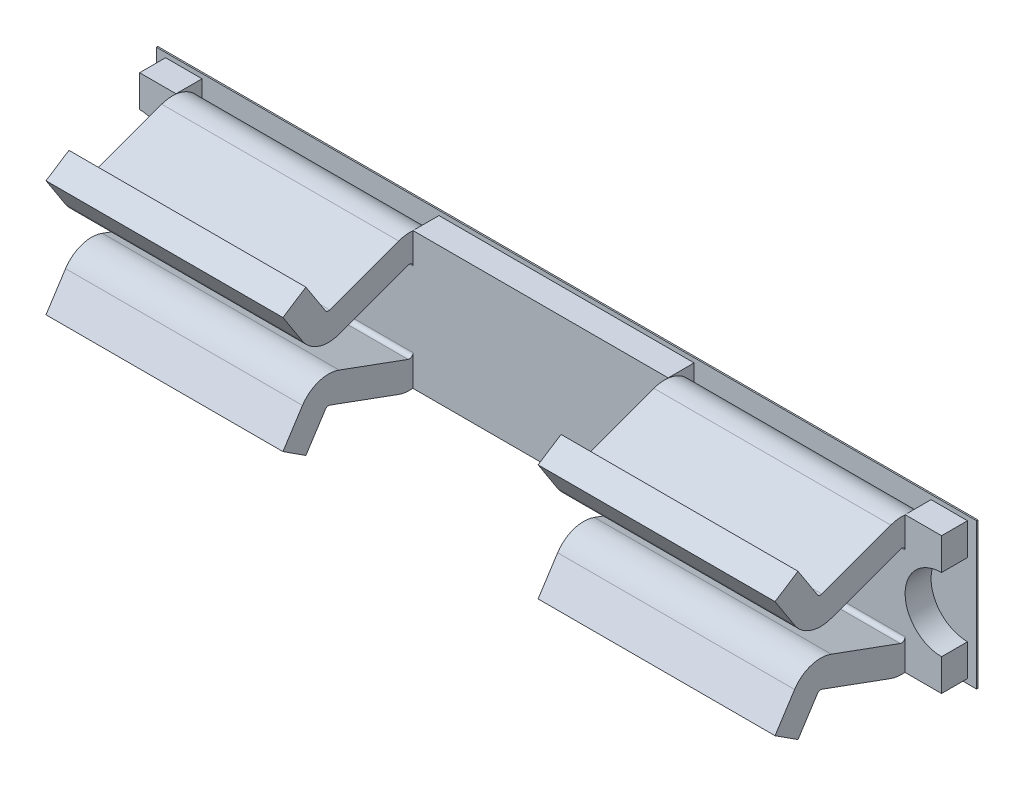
ISO-10303-21;
HEADER;
FILE_DESCRIPTION(('STEP AP214'),'2;1');
FILE_NAME('part.step','',(''),(''),'','','');
FILE_SCHEMA(('AUTOMOTIVE_DESIGN { 1 0 10303 214 1 1 1 1 }'));
ENDSEC;
DATA;
#1=APPLICATION_CONTEXT('core data for automotive mechanical design processes');
#2=APPLICATION_PROTOCOL_DEFINITION('international standard','automotive_design',2000,#1);
#3=PRODUCT_CONTEXT('',#1,'mechanical');
#4=PRODUCT('Part','Part','',(#3));
#5=PRODUCT_RELATED_PRODUCT_CATEGORY('part','',(#4));
#6=PRODUCT_DEFINITION_FORMATION('','',#4);
#7=PRODUCT_DEFINITION_CONTEXT('part definition',#1,'design');
#8=PRODUCT_DEFINITION('design','',#6,#7);
#9=PRODUCT_DEFINITION_SHAPE('','',#8);
#10=(LENGTH_UNIT() NAMED_UNIT(*) SI_UNIT(.MILLI.,.METRE.));
#11=(NAMED_UNIT(*) PLANE_ANGLE_UNIT() SI_UNIT($,.RADIAN.));
#12=(NAMED_UNIT(*) SI_UNIT($,.STERADIAN.) SOLID_ANGLE_UNIT());
#13=UNCERTAINTY_MEASURE_WITH_UNIT(LENGTH_MEASURE(1.E-05),#10,'distance_accuracy_value','');
#14=(GEOMETRIC_REPRESENTATION_CONTEXT(3) GLOBAL_UNCERTAINTY_ASSIGNED_CONTEXT((#13)) GLOBAL_UNIT_ASSIGNED_CONTEXT((#10,
#11,#12)) REPRESENTATION_CONTEXT('',''));
#15=CARTESIAN_POINT('',(0.,0.,0.));
#16=DIRECTION('',(0.,0.,1.));
#17=DIRECTION('',(1.,0.,0.));
#18=AXIS2_PLACEMENT_3D('',#15,#16,#17);
#19=CARTESIAN_POINT('',(-0.699999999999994,0.244999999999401,0.689799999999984));
#20=DIRECTION('',(1.,0.,0.));
#21=DIRECTION('',(0.,0.,-1.));
#22=AXIS2_PLACEMENT_3D('',#19,#20,#21);
#23=CYLINDRICAL_SURFACE('',#22,0.0199999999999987);
#24=CARTESIAN_POINT('',(-1.99999999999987,0.244999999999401,0.689799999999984));
#25=DIRECTION('',(1.,0.,0.));
#26=DIRECTION('',(0.,0.,-1.));
#27=AXIS2_PLACEMENT_3D('',#24,#25,#26);
#28=CIRCLE('',#27,0.0199999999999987);
#29=CARTESIAN_POINT('',(-1.99999999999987,0.226217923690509,0.682927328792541));
#30=VERTEX_POINT('',#29);
#31=CARTESIAN_POINT('',(-1.99999999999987,0.234140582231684,0.706595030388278));
#32=VERTEX_POINT('',#31);
#33=EDGE_CURVE('E19',#30,#32,#28,.F.);
#34=ORIENTED_EDGE('',*,*,#33,.T.);
#35=DIRECTION('',(1.,0.,0.));
#36=VECTOR('',#35,1.);
#37=CARTESIAN_POINT('',(-0.699999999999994,0.234140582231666,0.706595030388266));
#38=LINE('',#37,#36);
#39=CARTESIAN_POINT('',(-0.699999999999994,0.234140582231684,0.706595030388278));
#40=VERTEX_POINT('',#39);
#41=EDGE_CURVE('E444',#32,#40,#38,.T.);
#42=ORIENTED_EDGE('',*,*,#41,.T.);
#43=CARTESIAN_POINT('',(-0.699999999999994,0.244999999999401,0.689799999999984));
#44=DIRECTION('',(1.,0.,0.));
#45=DIRECTION('',(0.,0.,-1.));
#46=AXIS2_PLACEMENT_3D('',#43,#44,#45);
#47=CIRCLE('',#46,0.0199999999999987);
#48=CARTESIAN_POINT('',(-0.699999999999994,0.226217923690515,0.682927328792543));
#49=VERTEX_POINT('',#48);
#50=EDGE_CURVE('E436',#49,#40,#47,.F.);
#51=ORIENTED_EDGE('',*,*,#50,.F.);
#52=DIRECTION('',(1.,0.,0.));
#53=VECTOR('',#52,1.);
#54=CARTESIAN_POINT('',(-0.699999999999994,0.22621792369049,0.682927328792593));
#55=LINE('',#54,#53);
#56=EDGE_CURVE('E430',#49,#30,#55,.F.);
#57=ORIENTED_EDGE('',*,*,#56,.T.);
#58=EDGE_LOOP('',(#34,#42,#51,#57));
#59=FACE_BOUND('',#58,.T.);
#60=ADVANCED_FACE('F16',(#59),#23,.F.);
#61=CARTESIAN_POINT('',(-0.699999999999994,0.234140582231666,0.706595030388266));
#62=DIRECTION('',(0.,-0.542970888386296,0.839751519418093));
#63=DIRECTION('',(0.,-0.839751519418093,-0.542970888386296));
#64=AXIS2_PLACEMENT_3D('',#61,#62,#63);
#65=PLANE('',#64);
#66=DIRECTION('',(0.,0.839751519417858,0.542970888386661));
#67=VECTOR('',#66,1.);
#68=CARTESIAN_POINT('',(-1.99999999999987,0.234140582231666,0.706595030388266));
#69=LINE('',#68,#67);
#70=CARTESIAN_POINT('',(-1.99999999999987,0.399999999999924,0.813837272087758));
#71=VERTEX_POINT('',#70);
#72=EDGE_CURVE('E422',#32,#71,#69,.T.);
#73=ORIENTED_EDGE('',*,*,#72,.T.);
#74=DIRECTION('',(1.,0.,0.));
#75=VECTOR('',#74,1.);
#76=CARTESIAN_POINT('',(-0.699999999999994,0.399999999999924,0.813837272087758));
#77=LINE('',#76,#75);
#78=CARTESIAN_POINT('',(-0.699999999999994,0.399999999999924,0.813837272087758));
#79=VERTEX_POINT('',#78);
#80=EDGE_CURVE('E759',#71,#79,#77,.T.);
#81=ORIENTED_EDGE('',*,*,#80,.T.);
#82=DIRECTION('',(0.,0.839751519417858,0.542970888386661));
#83=VECTOR('',#82,1.);
#84=CARTESIAN_POINT('',(-0.699999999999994,0.234140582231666,0.706595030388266));
#85=LINE('',#84,#83);
#86=EDGE_CURVE('E630',#40,#79,#85,.T.);
#87=ORIENTED_EDGE('',*,*,#86,.F.);
#88=ORIENTED_EDGE('',*,*,#41,.F.);
#89=EDGE_LOOP('',(#73,#81,#87,#88));
#90=FACE_BOUND('',#89,.T.);
#91=ADVANCED_FACE('F772',(#90),#65,.F.);
#92=CARTESIAN_POINT('',(-0.699999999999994,0.399999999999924,0.813837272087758));
#93=DIRECTION('',(0.,-0.839751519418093,-0.542970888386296));
#94=DIRECTION('',(0.,0.542970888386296,-0.839751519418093));
#95=AXIS2_PLACEMENT_3D('',#92,#93,#94);
#96=PLANE('',#95);
#97=DIRECTION('',(0.,-0.54297088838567,0.839751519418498));
#98=VECTOR('',#97,1.);
#99=CARTESIAN_POINT('',(-1.99999999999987,0.399999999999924,0.813837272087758));
#100=LINE('',#99,#98);
#101=CARTESIAN_POINT('',(-1.99999999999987,0.318554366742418,0.9398));
#102=VERTEX_POINT('',#101);
#103=EDGE_CURVE('E446',#71,#102,#100,.T.);
#104=ORIENTED_EDGE('',*,*,#103,.T.);
#105=DIRECTION('',(1.,0.,0.));
#106=VECTOR('',#105,1.);
#107=CARTESIAN_POINT('',(-0.699999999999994,0.318554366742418,0.9398));
#108=LINE('',#107,#106);
#109=CARTESIAN_POINT('',(-0.699999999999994,0.318554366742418,0.9398));
#110=VERTEX_POINT('',#109);
#111=EDGE_CURVE('E756',#102,#110,#108,.T.);
#112=ORIENTED_EDGE('',*,*,#111,.T.);
#113=DIRECTION('',(0.,-0.54297088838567,0.839751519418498));
#114=VECTOR('',#113,1.);
#115=CARTESIAN_POINT('',(-0.699999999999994,0.399999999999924,0.813837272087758));
#116=LINE('',#115,#114);
#117=EDGE_CURVE('E762',#79,#110,#116,.T.);
#118=ORIENTED_EDGE('',*,*,#117,.F.);
#119=ORIENTED_EDGE('',*,*,#80,.F.);
#120=EDGE_LOOP('',(#104,#112,#118,#119));
#121=FACE_BOUND('',#120,.T.);
#122=ADVANCED_FACE('F1375',(#121),#96,.F.);
#123=CARTESIAN_POINT('',(-0.699999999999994,0.318554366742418,0.9398));
#124=DIRECTION('',(0.,0.542970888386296,-0.839751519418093));
#125=DIRECTION('',(0.,0.839751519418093,0.542970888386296));
#126=AXIS2_PLACEMENT_3D('',#123,#124,#125);
#127=PLANE('',#126);
#128=DIRECTION('',(0.,-0.839751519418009,-0.542970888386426));
#129=VECTOR('',#128,1.);
#130=CARTESIAN_POINT('',(-1.99999999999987,0.318554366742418,0.9398));
#131=LINE('',#130,#129);
#132=CARTESIAN_POINT('',(-1.99999999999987,0.152694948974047,0.832557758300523));
#133=VERTEX_POINT('',#132);
#134=EDGE_CURVE('E449',#102,#133,#131,.T.);
#135=ORIENTED_EDGE('',*,*,#134,.T.);
#136=DIRECTION('',(1.,0.,0.));
#137=VECTOR('',#136,1.);
#138=CARTESIAN_POINT('',(-0.699999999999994,0.152694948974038,0.832557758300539));
#139=LINE('',#138,#137);
#140=CARTESIAN_POINT('',(-0.699999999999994,0.152694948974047,0.832557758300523));
#141=VERTEX_POINT('',#140);
#142=EDGE_CURVE('E754',#141,#133,#139,.F.);
#143=ORIENTED_EDGE('',*,*,#142,.F.);
#144=DIRECTION('',(0.,-0.839751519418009,-0.542970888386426));
#145=VECTOR('',#144,1.);
#146=CARTESIAN_POINT('',(-0.699999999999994,0.318554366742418,0.9398));
#147=LINE('',#146,#145);
#148=EDGE_CURVE('E629',#110,#141,#147,.T.);
#149=ORIENTED_EDGE('',*,*,#148,.F.);
#150=ORIENTED_EDGE('',*,*,#111,.F.);
#151=EDGE_LOOP('',(#135,#143,#149,#150));
#152=FACE_BOUND('',#151,.T.);
#153=ADVANCED_FACE('F814',(#152),#127,.F.);
#154=CARTESIAN_POINT('',(-0.699999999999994,0.244999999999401,0.689799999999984));
#155=DIRECTION('',(1.,0.,0.));
#156=DIRECTION('',(0.,0.,-1.));
#157=AXIS2_PLACEMENT_3D('',#154,#155,#156);
#158=CYLINDRICAL_SURFACE('',#157,0.169999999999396);
#159=DIRECTION('',(1.,0.,0.));
#160=VECTOR('',#159,1.);
#161=CARTESIAN_POINT('',(-0.699999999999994,0.0853523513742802,0.631382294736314));
#162=LINE('',#161,#160);
#163=CARTESIAN_POINT('',(-1.99999999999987,0.0853523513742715,0.631382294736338));
#164=VERTEX_POINT('',#163);
#165=CARTESIAN_POINT('',(-0.699999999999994,0.0853523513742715,0.631382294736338));
#166=VERTEX_POINT('',#165);
#167=EDGE_CURVE('E743',#164,#166,#162,.T.);
#168=ORIENTED_EDGE('',*,*,#167,.T.);
#169=CARTESIAN_POINT('',(-0.699999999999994,0.244999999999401,0.689799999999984));
#170=DIRECTION('',(1.,0.,0.));
#171=DIRECTION('',(0.,0.,-1.));
#172=AXIS2_PLACEMENT_3D('',#169,#170,#171);
#173=CIRCLE('',#172,0.169999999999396);
#174=EDGE_CURVE('E627',#141,#166,#173,.T.);
#175=ORIENTED_EDGE('',*,*,#174,.F.);
#176=ORIENTED_EDGE('',*,*,#142,.T.);
#177=CARTESIAN_POINT('',(-1.99999999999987,0.244999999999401,0.689799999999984));
#178=DIRECTION('',(1.,0.,0.));
#179=DIRECTION('',(0.,0.,-1.));
#180=AXIS2_PLACEMENT_3D('',#177,#178,#179);
#181=CIRCLE('',#180,0.169999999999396);
#182=EDGE_CURVE('E631',#133,#164,#181,.T.);
#183=ORIENTED_EDGE('',*,*,#182,.T.);
#184=EDGE_LOOP('',(#168,#175,#176,#183));
#185=FACE_BOUND('',#184,.T.);
#186=ADVANCED_FACE('F815',(#185),#158,.T.);
#187=CARTESIAN_POINT('',(-0.699999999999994,0.0853523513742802,0.631382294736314));
#188=DIRECTION('',(0.,0.939103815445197,0.343633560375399));
#189=DIRECTION('',(0.,-0.343633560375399,0.939103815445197));
#190=AXIS2_PLACEMENT_3D('',#187,#188,#189);
#191=PLANE('',#190);
#192=DIRECTION('',(0.,0.34363356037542,-0.939103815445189));
#193=VECTOR('',#192,1.);
#194=CARTESIAN_POINT('',(-1.99999999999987,0.0853523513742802,0.631382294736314));
#195=LINE('',#194,#193);
#196=CARTESIAN_POINT('',(-1.99999999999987,0.223782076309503,0.253072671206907));
#197=VERTEX_POINT('',#196);
#198=EDGE_CURVE('E440',#164,#197,#195,.T.);
#199=ORIENTED_EDGE('',*,*,#198,.T.);
#200=DIRECTION('',(1.,0.,0.));
#201=VECTOR('',#200,1.);
#202=CARTESIAN_POINT('',(-0.699999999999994,0.223782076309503,0.25307267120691));
#203=LINE('',#202,#201);
#204=CARTESIAN_POINT('',(-0.699999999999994,0.223782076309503,0.253072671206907));
#205=VERTEX_POINT('',#204);
#206=EDGE_CURVE('E680',#197,#205,#203,.T.);
#207=ORIENTED_EDGE('',*,*,#206,.T.);
#208=DIRECTION('',(0.,0.34363356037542,-0.939103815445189));
#209=VECTOR('',#208,1.);
#210=CARTESIAN_POINT('',(-0.699999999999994,0.0853523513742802,0.631382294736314));
#211=LINE('',#210,#209);
#212=EDGE_CURVE('E626',#166,#205,#211,.T.);
#213=ORIENTED_EDGE('',*,*,#212,.F.);
#214=ORIENTED_EDGE('',*,*,#167,.F.);
#215=EDGE_LOOP('',(#199,#207,#213,#214));
#216=FACE_BOUND('',#215,.T.);
#217=ADVANCED_FACE('F819',(#216),#191,.F.);
#218=CARTESIAN_POINT('',(0.699999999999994,0.244999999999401,0.689799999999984));
#219=DIRECTION('',(1.,0.,0.));
#220=DIRECTION('',(0.,0.,-1.));
#221=AXIS2_PLACEMENT_3D('',#218,#219,#220);
#222=CYLINDRICAL_SURFACE('',#221,0.0199999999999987);
#223=CARTESIAN_POINT('',(1.99999999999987,0.244999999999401,0.689799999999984));
#224=DIRECTION('',(1.,0.,0.));
#225=DIRECTION('',(0.,0.,-1.));
#226=AXIS2_PLACEMENT_3D('',#223,#224,#225);
#227=CIRCLE('',#226,0.0199999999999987);
#228=CARTESIAN_POINT('',(1.99999999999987,0.226217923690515,0.682927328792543));
#229=VERTEX_POINT('',#228);
#230=CARTESIAN_POINT('',(1.99999999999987,0.234140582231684,0.706595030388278));
#231=VERTEX_POINT('',#230);
#232=EDGE_CURVE('E607',#229,#231,#227,.F.);
#233=ORIENTED_EDGE('',*,*,#232,.F.);
#234=DIRECTION('',(1.,0.,0.));
#235=VECTOR('',#234,1.);
#236=CARTESIAN_POINT('',(0.699999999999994,0.22621792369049,0.682927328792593));
#237=LINE('',#236,#235);
#238=CARTESIAN_POINT('',(0.699999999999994,0.226217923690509,0.682927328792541));
#239=VERTEX_POINT('',#238);
#240=EDGE_CURVE('E614',#239,#229,#237,.T.);
#241=ORIENTED_EDGE('',*,*,#240,.F.);
#242=CARTESIAN_POINT('',(0.699999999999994,0.244999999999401,0.689799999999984));
#243=DIRECTION('',(1.,0.,0.));
#244=DIRECTION('',(0.,0.,-1.));
#245=AXIS2_PLACEMENT_3D('',#242,#243,#244);
#246=CIRCLE('',#245,0.0199999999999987);
#247=CARTESIAN_POINT('',(0.699999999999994,0.234140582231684,0.706595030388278));
#248=VERTEX_POINT('',#247);
#249=EDGE_CURVE('E620',#239,#248,#246,.F.);
#250=ORIENTED_EDGE('',*,*,#249,.T.);
#251=DIRECTION('',(1.,0.,0.));
#252=VECTOR('',#251,1.);
#253=CARTESIAN_POINT('',(0.699999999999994,0.234140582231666,0.706595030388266));
#254=LINE('',#253,#252);
#255=EDGE_CURVE('E739',#231,#248,#254,.F.);
#256=ORIENTED_EDGE('',*,*,#255,.F.);
#257=EDGE_LOOP('',(#233,#241,#250,#256));
#258=FACE_BOUND('',#257,.T.);
#259=ADVANCED_FACE('F975',(#258),#222,.F.);
#260=CARTESIAN_POINT('',(0.699999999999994,0.234140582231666,0.706595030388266));
#261=DIRECTION('',(0.,0.542970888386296,-0.839751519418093));
#262=DIRECTION('',(0.,0.839751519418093,0.542970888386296));
#263=AXIS2_PLACEMENT_3D('',#260,#261,#262);
#264=PLANE('',#263);
#265=ORIENTED_EDGE('',*,*,#255,.T.);
#266=DIRECTION('',(0.,0.839751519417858,0.542970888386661));
#267=VECTOR('',#266,1.);
#268=CARTESIAN_POINT('',(0.699999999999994,0.234140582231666,0.706595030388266));
#269=LINE('',#268,#267);
#270=CARTESIAN_POINT('',(0.699999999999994,0.399999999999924,0.813837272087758));
#271=VERTEX_POINT('',#270);
#272=EDGE_CURVE('E623',#248,#271,#269,.T.);
#273=ORIENTED_EDGE('',*,*,#272,.T.);
#274=DIRECTION('',(1.,0.,0.));
#275=VECTOR('',#274,1.);
#276=CARTESIAN_POINT('',(0.699999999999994,0.399999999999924,0.813837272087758));
#277=LINE('',#276,#275);
#278=CARTESIAN_POINT('',(1.99999999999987,0.399999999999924,0.813837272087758));
#279=VERTEX_POINT('',#278);
#280=EDGE_CURVE('E731',#279,#271,#277,.F.);
#281=ORIENTED_EDGE('',*,*,#280,.F.);
#282=DIRECTION('',(0.,0.839751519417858,0.542970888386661));
#283=VECTOR('',#282,1.);
#284=CARTESIAN_POINT('',(1.99999999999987,0.234140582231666,0.706595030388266));
#285=LINE('',#284,#283);
#286=EDGE_CURVE('E609',#231,#279,#285,.T.);
#287=ORIENTED_EDGE('',*,*,#286,.F.);
#288=EDGE_LOOP('',(#265,#273,#281,#287));
#289=FACE_BOUND('',#288,.T.);
#290=ADVANCED_FACE('F962',(#289),#264,.T.);
#291=CARTESIAN_POINT('',(0.699999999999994,0.399999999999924,0.813837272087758));
#292=DIRECTION('',(0.,0.839751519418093,0.542970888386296));
#293=DIRECTION('',(0.,-0.542970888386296,0.839751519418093));
#294=AXIS2_PLACEMENT_3D('',#291,#292,#293);
#295=PLANE('',#294);
#296=ORIENTED_EDGE('',*,*,#280,.T.);
#297=DIRECTION('',(0.,-0.54297088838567,0.839751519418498));
#298=VECTOR('',#297,1.);
#299=CARTESIAN_POINT('',(0.699999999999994,0.399999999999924,0.813837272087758));
#300=LINE('',#299,#298);
#301=CARTESIAN_POINT('',(0.699999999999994,0.318554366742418,0.9398));
#302=VERTEX_POINT('',#301);
#303=EDGE_CURVE('E746',#271,#302,#300,.T.);
#304=ORIENTED_EDGE('',*,*,#303,.T.);
#305=DIRECTION('',(1.,0.,0.));
#306=VECTOR('',#305,1.);
#307=CARTESIAN_POINT('',(0.699999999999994,0.318554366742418,0.9398));
#308=LINE('',#307,#306);
#309=CARTESIAN_POINT('',(1.99999999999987,0.318554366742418,0.9398));
#310=VERTEX_POINT('',#309);
#311=EDGE_CURVE('E729',#310,#302,#308,.F.);
#312=ORIENTED_EDGE('',*,*,#311,.F.);
#313=DIRECTION('',(0.,-0.54297088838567,0.839751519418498));
#314=VECTOR('',#313,1.);
#315=CARTESIAN_POINT('',(1.99999999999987,0.399999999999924,0.813837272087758));
#316=LINE('',#315,#314);
#317=EDGE_CURVE('E734',#279,#310,#316,.T.);
#318=ORIENTED_EDGE('',*,*,#317,.F.);
#319=EDGE_LOOP('',(#296,#304,#312,#318));
#320=FACE_BOUND('',#319,.T.);
#321=ADVANCED_FACE('F1360',(#320),#295,.T.);
#322=CARTESIAN_POINT('',(0.699999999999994,0.318554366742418,0.9398));
#323=DIRECTION('',(0.,-0.542970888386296,0.839751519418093));
#324=DIRECTION('',(0.,-0.839751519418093,-0.542970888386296));
#325=AXIS2_PLACEMENT_3D('',#322,#323,#324);
#326=PLANE('',#325);
#327=ORIENTED_EDGE('',*,*,#311,.T.);
#328=DIRECTION('',(0.,-0.839751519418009,-0.542970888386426));
#329=VECTOR('',#328,1.);
#330=CARTESIAN_POINT('',(0.699999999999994,0.318554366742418,0.9398));
#331=LINE('',#330,#329);
#332=CARTESIAN_POINT('',(0.699999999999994,0.152694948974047,0.832557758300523));
#333=VERTEX_POINT('',#332);
#334=EDGE_CURVE('E619',#302,#333,#331,.T.);
#335=ORIENTED_EDGE('',*,*,#334,.T.);
#336=DIRECTION('',(1.,0.,0.));
#337=VECTOR('',#336,1.);
#338=CARTESIAN_POINT('',(0.699999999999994,0.152694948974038,0.832557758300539));
#339=LINE('',#338,#337);
#340=CARTESIAN_POINT('',(1.99999999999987,0.152694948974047,0.832557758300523));
#341=VERTEX_POINT('',#340);
#342=EDGE_CURVE('E727',#341,#333,#339,.F.);
#343=ORIENTED_EDGE('',*,*,#342,.F.);
#344=DIRECTION('',(0.,-0.839751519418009,-0.542970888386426));
#345=VECTOR('',#344,1.);
#346=CARTESIAN_POINT('',(1.99999999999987,0.318554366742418,0.9398));
#347=LINE('',#346,#345);
#348=EDGE_CURVE('E606',#310,#341,#347,.T.);
#349=ORIENTED_EDGE('',*,*,#348,.F.);
#350=EDGE_LOOP('',(#327,#335,#343,#349));
#351=FACE_BOUND('',#350,.T.);
#352=ADVANCED_FACE('F1356',(#351),#326,.T.);
#353=CARTESIAN_POINT('',(0.699999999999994,0.244999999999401,0.689799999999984));
#354=DIRECTION('',(1.,0.,0.));
#355=DIRECTION('',(0.,0.,-1.));
#356=AXIS2_PLACEMENT_3D('',#353,#354,#355);
#357=CYLINDRICAL_SURFACE('',#356,0.169999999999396);
#358=ORIENTED_EDGE('',*,*,#342,.T.);
#359=CARTESIAN_POINT('',(0.699999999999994,0.244999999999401,0.689799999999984));
#360=DIRECTION('',(1.,0.,0.));
#361=DIRECTION('',(0.,0.,-1.));
#362=AXIS2_PLACEMENT_3D('',#359,#360,#361);
#363=CIRCLE('',#362,0.169999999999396);
#364=CARTESIAN_POINT('',(0.699999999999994,0.0853523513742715,0.631382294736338));
#365=VERTEX_POINT('',#364);
#366=EDGE_CURVE('E616',#333,#365,#363,.T.);
#367=ORIENTED_EDGE('',*,*,#366,.T.);
#368=DIRECTION('',(1.,0.,0.));
#369=VECTOR('',#368,1.);
#370=CARTESIAN_POINT('',(0.699999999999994,0.0853523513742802,0.631382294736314));
#371=LINE('',#370,#369);
#372=CARTESIAN_POINT('',(1.99999999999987,0.0853523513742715,0.631382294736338));
#373=VERTEX_POINT('',#372);
#374=EDGE_CURVE('E717',#373,#365,#371,.F.);
#375=ORIENTED_EDGE('',*,*,#374,.F.);
#376=CARTESIAN_POINT('',(1.99999999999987,0.244999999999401,0.689799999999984));
#377=DIRECTION('',(1.,0.,0.));
#378=DIRECTION('',(0.,0.,-1.));
#379=AXIS2_PLACEMENT_3D('',#376,#377,#378);
#380=CIRCLE('',#379,0.169999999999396);
#381=EDGE_CURVE('E604',#341,#373,#380,.T.);
#382=ORIENTED_EDGE('',*,*,#381,.F.);
#383=EDGE_LOOP('',(#358,#367,#375,#382));
#384=FACE_BOUND('',#383,.T.);
#385=ADVANCED_FACE('F1352',(#384),#357,.T.);
#386=CARTESIAN_POINT('',(0.699999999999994,0.0853523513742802,0.631382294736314));
#387=DIRECTION('',(0.,-0.939103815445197,-0.343633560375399));
#388=DIRECTION('',(0.,0.343633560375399,-0.939103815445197));
#389=AXIS2_PLACEMENT_3D('',#386,#387,#388);
#390=PLANE('',#389);
#391=ORIENTED_EDGE('',*,*,#374,.T.);
#392=DIRECTION('',(0.,0.34363356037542,-0.939103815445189));
#393=VECTOR('',#392,1.);
#394=CARTESIAN_POINT('',(0.699999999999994,0.0853523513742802,0.631382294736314));
#395=LINE('',#394,#393);
#396=CARTESIAN_POINT('',(0.699999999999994,0.223782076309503,0.253072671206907));
#397=VERTEX_POINT('',#396);
#398=EDGE_CURVE('E615',#365,#397,#395,.T.);
#399=ORIENTED_EDGE('',*,*,#398,.T.);
#400=DIRECTION('',(1.,0.,0.));
#401=VECTOR('',#400,1.);
#402=CARTESIAN_POINT('',(0.699999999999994,0.223782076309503,0.25307267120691));
#403=LINE('',#402,#401);
#404=CARTESIAN_POINT('',(1.99999999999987,0.223782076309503,0.253072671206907));
#405=VERTEX_POINT('',#404);
#406=EDGE_CURVE('E719',#397,#405,#403,.T.);
#407=ORIENTED_EDGE('',*,*,#406,.T.);
#408=DIRECTION('',(0.,0.34363356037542,-0.939103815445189));
#409=VECTOR('',#408,1.);
#410=CARTESIAN_POINT('',(1.99999999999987,0.0853523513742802,0.631382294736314));
#411=LINE('',#410,#409);
#412=EDGE_CURVE('E603',#373,#405,#411,.T.);
#413=ORIENTED_EDGE('',*,*,#412,.F.);
#414=EDGE_LOOP('',(#391,#399,#407,#413));
#415=FACE_BOUND('',#414,.T.);
#416=ADVANCED_FACE('F1348',(#415),#390,.T.);
#417=CARTESIAN_POINT('',(0.699999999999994,-0.223782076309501,0.253072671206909));
#418=DIRECTION('',(0.,0.939103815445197,-0.343633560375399));
#419=DIRECTION('',(0.,0.343633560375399,0.939103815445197));
#420=AXIS2_PLACEMENT_3D('',#417,#418,#419);
#421=PLANE('',#420);
#422=DIRECTION('',(1.,0.,0.));
#423=VECTOR('',#422,1.);
#424=CARTESIAN_POINT('',(0.699999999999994,-0.223782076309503,0.25307267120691));
#425=LINE('',#424,#423);
#426=CARTESIAN_POINT('',(1.99999999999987,-0.223782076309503,0.253072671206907));
#427=VERTEX_POINT('',#426);
#428=CARTESIAN_POINT('',(0.699999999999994,-0.223782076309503,0.253072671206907));
#429=VERTEX_POINT('',#428);
#430=EDGE_CURVE('E699',#427,#429,#425,.F.);
#431=ORIENTED_EDGE('',*,*,#430,.T.);
#432=DIRECTION('',(0.,0.34363356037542,0.939103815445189));
#433=VECTOR('',#432,1.);
#434=CARTESIAN_POINT('',(0.699999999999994,-0.223782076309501,0.253072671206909));
#435=LINE('',#434,#433);
#436=CARTESIAN_POINT('',(0.699999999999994,-0.0853523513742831,0.631382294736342));
#437=VERTEX_POINT('',#436);
#438=EDGE_CURVE('E585',#429,#437,#435,.T.);
#439=ORIENTED_EDGE('',*,*,#438,.T.);
#440=DIRECTION('',(1.,0.,0.));
#441=VECTOR('',#440,1.);
#442=CARTESIAN_POINT('',(0.699999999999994,-0.0853523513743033,0.631382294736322));
#443=LINE('',#442,#441);
#444=CARTESIAN_POINT('',(1.99999999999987,-0.0853523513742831,0.631382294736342));
#445=VERTEX_POINT('',#444);
#446=EDGE_CURVE('E715',#445,#437,#443,.F.);
#447=ORIENTED_EDGE('',*,*,#446,.F.);
#448=DIRECTION('',(0.,0.34363356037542,0.939103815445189));
#449=VECTOR('',#448,1.);
#450=CARTESIAN_POINT('',(1.99999999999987,-0.223782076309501,0.253072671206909));
#451=LINE('',#450,#449);
#452=EDGE_CURVE('E597',#427,#445,#451,.T.);
#453=ORIENTED_EDGE('',*,*,#452,.F.);
#454=EDGE_LOOP('',(#431,#439,#447,#453));
#455=FACE_BOUND('',#454,.T.);
#456=ADVANCED_FACE('F1344',(#455),#421,.T.);
#457=CARTESIAN_POINT('',(0.699999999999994,-0.244999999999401,0.689799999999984));
#458=DIRECTION('',(1.,0.,0.));
#459=DIRECTION('',(0.,0.,-1.));
#460=AXIS2_PLACEMENT_3D('',#457,#458,#459);
#461=CYLINDRICAL_SURFACE('',#460,0.169999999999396);
#462=ORIENTED_EDGE('',*,*,#446,.T.);
#463=CARTESIAN_POINT('',(0.699999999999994,-0.244999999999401,0.689799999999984));
#464=DIRECTION('',(1.,0.,0.));
#465=DIRECTION('',(0.,0.,-1.));
#466=AXIS2_PLACEMENT_3D('',#463,#464,#465);
#467=CIRCLE('',#466,0.169999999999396);
#468=CARTESIAN_POINT('',(0.699999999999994,-0.152694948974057,0.832557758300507));
#469=VERTEX_POINT('',#468);
#470=EDGE_CURVE('E581',#437,#469,#467,.T.);
#471=ORIENTED_EDGE('',*,*,#470,.T.);
#472=DIRECTION('',(1.,0.,0.));
#473=VECTOR('',#472,1.);
#474=CARTESIAN_POINT('',(0.699999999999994,-0.152694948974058,0.832557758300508));
#475=LINE('',#474,#473);
#476=CARTESIAN_POINT('',(1.99999999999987,-0.152694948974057,0.832557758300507));
#477=VERTEX_POINT('',#476);
#478=EDGE_CURVE('E711',#477,#469,#475,.F.);
#479=ORIENTED_EDGE('',*,*,#478,.F.);
#480=CARTESIAN_POINT('',(1.99999999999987,-0.244999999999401,0.689799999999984));
#481=DIRECTION('',(1.,0.,0.));
#482=DIRECTION('',(0.,0.,-1.));
#483=AXIS2_PLACEMENT_3D('',#480,#481,#482);
#484=CIRCLE('',#483,0.169999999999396);
#485=EDGE_CURVE('E594',#445,#477,#484,.T.);
#486=ORIENTED_EDGE('',*,*,#485,.F.);
#487=EDGE_LOOP('',(#462,#471,#479,#486));
#488=FACE_BOUND('',#487,.T.);
#489=ADVANCED_FACE('F1340',(#488),#461,.T.);
#490=CARTESIAN_POINT('',(0.699999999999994,-0.152694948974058,0.832557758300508));
#491=DIRECTION('',(0.,0.542970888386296,0.839751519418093));
#492=DIRECTION('',(0.,-0.839751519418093,0.542970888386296));
#493=AXIS2_PLACEMENT_3D('',#490,#491,#492);
#494=PLANE('',#493);
#495=ORIENTED_EDGE('',*,*,#478,.T.);
#496=DIRECTION('',(0.,-0.839751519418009,0.542970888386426));
#497=VECTOR('',#496,1.);
#498=CARTESIAN_POINT('',(0.699999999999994,-0.152694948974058,0.832557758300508));
#499=LINE('',#498,#497);
#500=CARTESIAN_POINT('',(0.699999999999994,-0.318554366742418,0.9398));
#501=VERTEX_POINT('',#500);
#502=EDGE_CURVE('E584',#469,#501,#499,.T.);
#503=ORIENTED_EDGE('',*,*,#502,.T.);
#504=DIRECTION('',(1.,0.,0.));
#505=VECTOR('',#504,1.);
#506=CARTESIAN_POINT('',(0.699999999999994,-0.318554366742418,0.9398));
#507=LINE('',#506,#505);
#508=CARTESIAN_POINT('',(1.99999999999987,-0.318554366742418,0.9398));
#509=VERTEX_POINT('',#508);
#510=EDGE_CURVE('E702',#509,#501,#507,.F.);
#511=ORIENTED_EDGE('',*,*,#510,.F.);
#512=DIRECTION('',(0.,-0.839751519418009,0.542970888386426));
#513=VECTOR('',#512,1.);
#514=CARTESIAN_POINT('',(1.99999999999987,-0.152694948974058,0.832557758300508));
#515=LINE('',#514,#513);
#516=EDGE_CURVE('E596',#477,#509,#515,.T.);
#517=ORIENTED_EDGE('',*,*,#516,.F.);
#518=EDGE_LOOP('',(#495,#503,#511,#517));
#519=FACE_BOUND('',#518,.T.);
#520=ADVANCED_FACE('F1336',(#519),#494,.T.);
#521=CARTESIAN_POINT('',(0.699999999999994,-0.318554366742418,0.9398));
#522=DIRECTION('',(0.,-0.839751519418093,0.542970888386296));
#523=DIRECTION('',(0.,-0.542970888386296,-0.839751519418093));
#524=AXIS2_PLACEMENT_3D('',#521,#522,#523);
#525=PLANE('',#524);
#526=ORIENTED_EDGE('',*,*,#510,.T.);
#527=DIRECTION('',(0.,-0.54297088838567,-0.839751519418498));
#528=VECTOR('',#527,1.);
#529=CARTESIAN_POINT('',(0.699999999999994,-0.318554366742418,0.9398));
#530=LINE('',#529,#528);
#531=CARTESIAN_POINT('',(0.699999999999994,-0.399999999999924,0.813837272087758));
#532=VERTEX_POINT('',#531);
#533=EDGE_CURVE('E705',#501,#532,#530,.T.);
#534=ORIENTED_EDGE('',*,*,#533,.T.);
#535=DIRECTION('',(1.,0.,0.));
#536=VECTOR('',#535,1.);
#537=CARTESIAN_POINT('',(0.699999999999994,-0.399999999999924,0.813837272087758));
#538=LINE('',#537,#536);
#539=CARTESIAN_POINT('',(1.99999999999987,-0.399999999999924,0.813837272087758));
#540=VERTEX_POINT('',#539);
#541=EDGE_CURVE('E700',#540,#532,#538,.F.);
#542=ORIENTED_EDGE('',*,*,#541,.F.);
#543=DIRECTION('',(0.,-0.54297088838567,-0.839751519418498));
#544=VECTOR('',#543,1.);
#545=CARTESIAN_POINT('',(1.99999999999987,-0.318554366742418,0.9398));
#546=LINE('',#545,#544);
#547=EDGE_CURVE('E720',#509,#540,#546,.T.);
#548=ORIENTED_EDGE('',*,*,#547,.F.);
#549=EDGE_LOOP('',(#526,#534,#542,#548));
#550=FACE_BOUND('',#549,.T.);
#551=ADVANCED_FACE('F1332',(#550),#525,.T.);
#552=CARTESIAN_POINT('',(0.699999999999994,-0.399999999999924,0.813837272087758));
#553=DIRECTION('',(0.,-0.542970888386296,-0.839751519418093));
#554=DIRECTION('',(0.,0.839751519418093,-0.542970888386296));
#555=AXIS2_PLACEMENT_3D('',#552,#553,#554);
#556=PLANE('',#555);
#557=ORIENTED_EDGE('',*,*,#541,.T.);
#558=DIRECTION('',(0.,0.839751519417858,-0.542970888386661));
#559=VECTOR('',#558,1.);
#560=CARTESIAN_POINT('',(0.699999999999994,-0.399999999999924,0.813837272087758));
#561=LINE('',#560,#559);
#562=CARTESIAN_POINT('',(0.699999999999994,-0.234140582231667,0.706595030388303));
#563=VERTEX_POINT('',#562);
#564=EDGE_CURVE('E580',#532,#563,#561,.T.);
#565=ORIENTED_EDGE('',*,*,#564,.T.);
#566=DIRECTION('',(1.,0.,0.));
#567=VECTOR('',#566,1.);
#568=CARTESIAN_POINT('',(0.699999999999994,-0.234140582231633,0.706595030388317));
#569=LINE('',#568,#567);
#570=CARTESIAN_POINT('',(1.99999999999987,-0.234140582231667,0.706595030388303));
#571=VERTEX_POINT('',#570);
#572=EDGE_CURVE('E696',#563,#571,#569,.T.);
#573=ORIENTED_EDGE('',*,*,#572,.T.);
#574=DIRECTION('',(0.,0.839751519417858,-0.542970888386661));
#575=VECTOR('',#574,1.);
#576=CARTESIAN_POINT('',(1.99999999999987,-0.399999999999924,0.813837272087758));
#577=LINE('',#576,#575);
#578=EDGE_CURVE('E593',#540,#571,#577,.T.);
#579=ORIENTED_EDGE('',*,*,#578,.F.);
#580=EDGE_LOOP('',(#557,#565,#573,#579));
#581=FACE_BOUND('',#580,.T.);
#582=ADVANCED_FACE('F1328',(#581),#556,.T.);
#583=CARTESIAN_POINT('',(0.699999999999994,-0.244999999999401,0.689799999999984));
#584=DIRECTION('',(1.,0.,0.));
#585=DIRECTION('',(0.,0.,-1.));
#586=AXIS2_PLACEMENT_3D('',#583,#584,#585);
#587=CYLINDRICAL_SURFACE('',#586,0.0199999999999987);
#588=CARTESIAN_POINT('',(1.99999999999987,-0.244999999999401,0.689799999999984));
#589=DIRECTION('',(1.,0.,0.));
#590=DIRECTION('',(0.,0.,-1.));
#591=AXIS2_PLACEMENT_3D('',#588,#589,#590);
#592=CIRCLE('',#591,0.0199999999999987);
#593=CARTESIAN_POINT('',(1.99999999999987,-0.226217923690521,0.682927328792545));
#594=VERTEX_POINT('',#593);
#595=EDGE_CURVE('E590',#571,#594,#592,.F.);
#596=ORIENTED_EDGE('',*,*,#595,.F.);
#597=ORIENTED_EDGE('',*,*,#572,.F.);
#598=CARTESIAN_POINT('',(0.699999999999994,-0.244999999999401,0.689799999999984));
#599=DIRECTION('',(1.,0.,0.));
#600=DIRECTION('',(0.,0.,-1.));
#601=AXIS2_PLACEMENT_3D('',#598,#599,#600);
#602=CIRCLE('',#601,0.0199999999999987);
#603=CARTESIAN_POINT('',(0.699999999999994,-0.226217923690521,0.682927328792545));
#604=VERTEX_POINT('',#603);
#605=EDGE_CURVE('E577',#563,#604,#602,.F.);
#606=ORIENTED_EDGE('',*,*,#605,.T.);
#607=DIRECTION('',(1.,0.,0.));
#608=VECTOR('',#607,1.);
#609=CARTESIAN_POINT('',(0.699999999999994,-0.226217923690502,0.682927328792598));
#610=LINE('',#609,#608);
#611=EDGE_CURVE('E589',#594,#604,#610,.F.);
#612=ORIENTED_EDGE('',*,*,#611,.F.);
#613=EDGE_LOOP('',(#596,#597,#606,#612));
#614=FACE_BOUND('',#613,.T.);
#615=ADVANCED_FACE('F1324',(#614),#587,.F.);
#616=CARTESIAN_POINT('',(0.699999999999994,-0.205000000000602,0.246199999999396));
#617=DIRECTION('',(1.,0.,0.));
#618=DIRECTION('',(0.,0.,-1.));
#619=AXIS2_PLACEMENT_3D('',#616,#617,#618);
#620=CYLINDRICAL_SURFACE('',#619,0.0199999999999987);
#621=ORIENTED_EDGE('',*,*,#430,.F.);
#622=CARTESIAN_POINT('',(1.99999999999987,-0.205000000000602,0.246199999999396));
#623=DIRECTION('',(1.,0.,0.));
#624=DIRECTION('',(0.,0.,-1.));
#625=AXIS2_PLACEMENT_3D('',#622,#623,#624);
#626=CIRCLE('',#625,0.0199999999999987);
#627=CARTESIAN_POINT('',(1.99999999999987,-0.205000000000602,0.2261999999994));
#628=VERTEX_POINT('',#627);
#629=EDGE_CURVE('E598',#628,#427,#626,.F.);
#630=ORIENTED_EDGE('',*,*,#629,.F.);
#631=DIRECTION('',(1.,0.,0.));
#632=VECTOR('',#631,1.);
#633=CARTESIAN_POINT('',(0.,-0.205000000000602,0.2261999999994));
#634=LINE('',#633,#632);
#635=CARTESIAN_POINT('',(0.699999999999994,-0.205000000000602,0.2261999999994));
#636=VERTEX_POINT('',#635);
#637=EDGE_CURVE('E692',#636,#628,#634,.T.);
#638=ORIENTED_EDGE('',*,*,#637,.F.);
#639=CARTESIAN_POINT('',(0.699999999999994,-0.205000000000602,0.246199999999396));
#640=DIRECTION('',(1.,0.,0.));
#641=DIRECTION('',(0.,0.,-1.));
#642=AXIS2_PLACEMENT_3D('',#639,#640,#641);
#643=CIRCLE('',#642,0.0199999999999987);
#644=EDGE_CURVE('E586',#636,#429,#643,.F.);
#645=ORIENTED_EDGE('',*,*,#644,.T.);
#646=EDGE_LOOP('',(#621,#630,#638,#645));
#647=FACE_BOUND('',#646,.T.);
#648=ADVANCED_FACE('F1320',(#647),#620,.F.);
#649=CARTESIAN_POINT('',(0.699999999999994,0.205000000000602,0.246199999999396));
#650=DIRECTION('',(1.,0.,0.));
#651=DIRECTION('',(0.,0.,-1.));
#652=AXIS2_PLACEMENT_3D('',#649,#650,#651);
#653=CYLINDRICAL_SURFACE('',#652,0.0199999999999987);
#654=ORIENTED_EDGE('',*,*,#406,.F.);
#655=CARTESIAN_POINT('',(0.699999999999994,0.205000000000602,0.246199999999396));
#656=DIRECTION('',(1.,0.,0.));
#657=DIRECTION('',(0.,0.,-1.));
#658=AXIS2_PLACEMENT_3D('',#655,#656,#657);
#659=CIRCLE('',#658,0.0199999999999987);
#660=CARTESIAN_POINT('',(0.699999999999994,0.205000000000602,0.2261999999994));
#661=VERTEX_POINT('',#660);
#662=EDGE_CURVE('E611',#397,#661,#659,.F.);
#663=ORIENTED_EDGE('',*,*,#662,.T.);
#664=DIRECTION('',(1.,0.,0.));
#665=VECTOR('',#664,1.);
#666=CARTESIAN_POINT('',(0.,0.205000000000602,0.2261999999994));
#667=LINE('',#666,#665);
#668=CARTESIAN_POINT('',(1.99999999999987,0.205000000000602,0.2261999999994));
#669=VERTEX_POINT('',#668);
#670=EDGE_CURVE('E688',#669,#661,#667,.F.);
#671=ORIENTED_EDGE('',*,*,#670,.F.);
#672=CARTESIAN_POINT('',(1.99999999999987,0.205000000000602,0.246199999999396));
#673=DIRECTION('',(1.,0.,0.));
#674=DIRECTION('',(0.,0.,-1.));
#675=AXIS2_PLACEMENT_3D('',#672,#673,#674);
#676=CIRCLE('',#675,0.0199999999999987);
#677=EDGE_CURVE('E601',#405,#669,#676,.F.);
#678=ORIENTED_EDGE('',*,*,#677,.F.);
#679=EDGE_LOOP('',(#654,#663,#671,#678));
#680=FACE_BOUND('',#679,.T.);
#681=ADVANCED_FACE('F1317',(#680),#653,.F.);
#682=CARTESIAN_POINT('',(-0.699999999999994,0.205000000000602,0.246199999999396));
#683=DIRECTION('',(1.,0.,0.));
#684=DIRECTION('',(0.,0.,-1.));
#685=AXIS2_PLACEMENT_3D('',#682,#683,#684);
#686=CYLINDRICAL_SURFACE('',#685,0.0199999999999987);
#687=CARTESIAN_POINT('',(-1.99999999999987,0.205000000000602,0.246199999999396));
#688=DIRECTION('',(1.,0.,0.));
#689=DIRECTION('',(0.,0.,-1.));
#690=AXIS2_PLACEMENT_3D('',#687,#688,#689);
#691=CIRCLE('',#690,0.0199999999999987);
#692=CARTESIAN_POINT('',(-1.99999999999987,0.205000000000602,0.2261999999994));
#693=VERTEX_POINT('',#692);
#694=EDGE_CURVE('E437',#197,#693,#691,.F.);
#695=ORIENTED_EDGE('',*,*,#694,.T.);
#696=DIRECTION('',(1.,0.,0.));
#697=VECTOR('',#696,1.);
#698=CARTESIAN_POINT('',(0.,0.205000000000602,0.2261999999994));
#699=LINE('',#698,#697);
#700=CARTESIAN_POINT('',(-0.699999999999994,0.205000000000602,0.2261999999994));
#701=VERTEX_POINT('',#700);
#702=EDGE_CURVE('E685',#701,#693,#699,.F.);
#703=ORIENTED_EDGE('',*,*,#702,.F.);
#704=CARTESIAN_POINT('',(-0.699999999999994,0.205000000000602,0.246199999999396));
#705=DIRECTION('',(1.,0.,0.));
#706=DIRECTION('',(0.,0.,-1.));
#707=AXIS2_PLACEMENT_3D('',#704,#705,#706);
#708=CIRCLE('',#707,0.0199999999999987);
#709=EDGE_CURVE('E624',#205,#701,#708,.F.);
#710=ORIENTED_EDGE('',*,*,#709,.F.);
#711=ORIENTED_EDGE('',*,*,#206,.F.);
#712=EDGE_LOOP('',(#695,#703,#710,#711));
#713=FACE_BOUND('',#712,.T.);
#714=ADVANCED_FACE('F821',(#713),#686,.F.);
#715=CARTESIAN_POINT('',(-0.699999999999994,-0.205000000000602,0.246199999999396));
#716=DIRECTION('',(1.,0.,0.));
#717=DIRECTION('',(0.,0.,-1.));
#718=AXIS2_PLACEMENT_3D('',#715,#716,#717);
#719=CYLINDRICAL_SURFACE('',#718,0.0199999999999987);
#720=CARTESIAN_POINT('',(-1.99999999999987,-0.205000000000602,0.246199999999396));
#721=DIRECTION('',(1.,0.,0.));
#722=DIRECTION('',(0.,0.,-1.));
#723=AXIS2_PLACEMENT_3D('',#720,#721,#722);
#724=CIRCLE('',#723,0.0199999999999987);
#725=CARTESIAN_POINT('',(-1.99999999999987,-0.205000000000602,0.2261999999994));
#726=VERTEX_POINT('',#725);
#727=CARTESIAN_POINT('',(-1.99999999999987,-0.223782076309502,0.253072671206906));
#728=VERTEX_POINT('',#727);
#729=EDGE_CURVE('E549',#726,#728,#724,.F.);
#730=ORIENTED_EDGE('',*,*,#729,.T.);
#731=DIRECTION('',(1.,0.,0.));
#732=VECTOR('',#731,1.);
#733=CARTESIAN_POINT('',(-0.699999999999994,-0.223782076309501,0.253072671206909));
#734=LINE('',#733,#732);
#735=CARTESIAN_POINT('',(-0.699999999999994,-0.223782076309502,0.253072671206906));
#736=VERTEX_POINT('',#735);
#737=EDGE_CURVE('E678',#728,#736,#734,.T.);
#738=ORIENTED_EDGE('',*,*,#737,.T.);
#739=CARTESIAN_POINT('',(-0.699999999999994,-0.205000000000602,0.246199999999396));
#740=DIRECTION('',(1.,0.,0.));
#741=DIRECTION('',(0.,0.,-1.));
#742=AXIS2_PLACEMENT_3D('',#739,#740,#741);
#743=CIRCLE('',#742,0.0199999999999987);
#744=CARTESIAN_POINT('',(-0.699999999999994,-0.205000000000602,0.2261999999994));
#745=VERTEX_POINT('',#744);
#746=EDGE_CURVE('E553',#745,#736,#743,.F.);
#747=ORIENTED_EDGE('',*,*,#746,.F.);
#748=DIRECTION('',(1.,0.,0.));
#749=VECTOR('',#748,1.);
#750=CARTESIAN_POINT('',(0.,-0.205000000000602,0.2261999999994));
#751=LINE('',#750,#749);
#752=EDGE_CURVE('E567',#726,#745,#751,.T.);
#753=ORIENTED_EDGE('',*,*,#752,.F.);
#754=EDGE_LOOP('',(#730,#738,#747,#753));
#755=FACE_BOUND('',#754,.T.);
#756=ADVANCED_FACE('F1310',(#755),#719,.F.);
#757=CARTESIAN_POINT('',(-0.699999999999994,-0.223782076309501,0.253072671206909));
#758=DIRECTION('',(0.,-0.939103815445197,0.343633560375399));
#759=DIRECTION('',(0.,-0.343633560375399,-0.939103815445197));
#760=AXIS2_PLACEMENT_3D('',#757,#758,#759);
#761=PLANE('',#760);
#762=DIRECTION('',(0.,0.34363356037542,0.939103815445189));
#763=VECTOR('',#762,1.);
#764=CARTESIAN_POINT('',(-1.99999999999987,-0.223782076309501,0.253072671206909));
#765=LINE('',#764,#763);
#766=CARTESIAN_POINT('',(-1.99999999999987,-0.0853523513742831,0.631382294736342));
#767=VERTEX_POINT('',#766);
#768=EDGE_CURVE('E548',#728,#767,#765,.T.);
#769=ORIENTED_EDGE('',*,*,#768,.T.);
#770=DIRECTION('',(1.,0.,0.));
#771=VECTOR('',#770,1.);
#772=CARTESIAN_POINT('',(-0.699999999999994,-0.0853523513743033,0.631382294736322));
#773=LINE('',#772,#771);
#774=CARTESIAN_POINT('',(-0.699999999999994,-0.0853523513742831,0.631382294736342));
#775=VERTEX_POINT('',#774);
#776=EDGE_CURVE('E676',#775,#767,#773,.F.);
#777=ORIENTED_EDGE('',*,*,#776,.F.);
#778=DIRECTION('',(0.,0.34363356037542,0.939103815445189));
#779=VECTOR('',#778,1.);
#780=CARTESIAN_POINT('',(-0.699999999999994,-0.223782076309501,0.253072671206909));
#781=LINE('',#780,#779);
#782=EDGE_CURVE('E564',#736,#775,#781,.T.);
#783=ORIENTED_EDGE('',*,*,#782,.F.);
#784=ORIENTED_EDGE('',*,*,#737,.F.);
#785=EDGE_LOOP('',(#769,#777,#783,#784));
#786=FACE_BOUND('',#785,.T.);
#787=ADVANCED_FACE('F1306',(#786),#761,.F.);
#788=CARTESIAN_POINT('',(-0.699999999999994,-0.244999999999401,0.689799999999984));
#789=DIRECTION('',(1.,0.,0.));
#790=DIRECTION('',(0.,0.,-1.));
#791=AXIS2_PLACEMENT_3D('',#788,#789,#790);
#792=CYLINDRICAL_SURFACE('',#791,0.169999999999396);
#793=DIRECTION('',(1.,0.,0.));
#794=VECTOR('',#793,1.);
#795=CARTESIAN_POINT('',(-0.699999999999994,-0.152694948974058,0.832557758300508));
#796=LINE('',#795,#794);
#797=CARTESIAN_POINT('',(-1.99999999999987,-0.152694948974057,0.832557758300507));
#798=VERTEX_POINT('',#797);
#799=CARTESIAN_POINT('',(-0.699999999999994,-0.152694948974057,0.832557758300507));
#800=VERTEX_POINT('',#799);
#801=EDGE_CURVE('E671',#798,#800,#796,.T.);
#802=ORIENTED_EDGE('',*,*,#801,.T.);
#803=CARTESIAN_POINT('',(-0.699999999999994,-0.244999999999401,0.689799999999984));
#804=DIRECTION('',(1.,0.,0.));
#805=DIRECTION('',(0.,0.,-1.));
#806=AXIS2_PLACEMENT_3D('',#803,#804,#805);
#807=CIRCLE('',#806,0.169999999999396);
#808=EDGE_CURVE('E561',#775,#800,#807,.T.);
#809=ORIENTED_EDGE('',*,*,#808,.F.);
#810=ORIENTED_EDGE('',*,*,#776,.T.);
#811=CARTESIAN_POINT('',(-1.99999999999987,-0.244999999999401,0.689799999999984));
#812=DIRECTION('',(1.,0.,0.));
#813=DIRECTION('',(0.,0.,-1.));
#814=AXIS2_PLACEMENT_3D('',#811,#812,#813);
#815=CIRCLE('',#814,0.169999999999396);
#816=EDGE_CURVE('E544',#767,#798,#815,.T.);
#817=ORIENTED_EDGE('',*,*,#816,.T.);
#818=EDGE_LOOP('',(#802,#809,#810,#817));
#819=FACE_BOUND('',#818,.T.);
#820=ADVANCED_FACE('F1302',(#819),#792,.T.);
#821=CARTESIAN_POINT('',(-0.699999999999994,-0.152694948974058,0.832557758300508));
#822=DIRECTION('',(0.,-0.542970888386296,-0.839751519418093));
#823=DIRECTION('',(0.,0.839751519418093,-0.542970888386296));
#824=AXIS2_PLACEMENT_3D('',#821,#822,#823);
#825=PLANE('',#824);
#826=DIRECTION('',(0.,-0.839751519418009,0.542970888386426));
#827=VECTOR('',#826,1.);
#828=CARTESIAN_POINT('',(-1.99999999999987,-0.152694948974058,0.832557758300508));
#829=LINE('',#828,#827);
#830=CARTESIAN_POINT('',(-1.99999999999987,-0.318554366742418,0.9398));
#831=VERTEX_POINT('',#830);
#832=EDGE_CURVE('E547',#798,#831,#829,.T.);
#833=ORIENTED_EDGE('',*,*,#832,.T.);
#834=DIRECTION('',(1.,0.,0.));
#835=VECTOR('',#834,1.);
#836=CARTESIAN_POINT('',(-0.699999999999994,-0.318554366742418,0.9398));
#837=LINE('',#836,#835);
#838=CARTESIAN_POINT('',(-0.699999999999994,-0.318554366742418,0.9398));
#839=VERTEX_POINT('',#838);
#840=EDGE_CURVE('E661',#831,#839,#837,.T.);
#841=ORIENTED_EDGE('',*,*,#840,.T.);
#842=DIRECTION('',(0.,-0.839751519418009,0.542970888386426));
#843=VECTOR('',#842,1.);
#844=CARTESIAN_POINT('',(-0.699999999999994,-0.152694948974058,0.832557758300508));
#845=LINE('',#844,#843);
#846=EDGE_CURVE('E563',#800,#839,#845,.T.);
#847=ORIENTED_EDGE('',*,*,#846,.F.);
#848=ORIENTED_EDGE('',*,*,#801,.F.);
#849=EDGE_LOOP('',(#833,#841,#847,#848));
#850=FACE_BOUND('',#849,.T.);
#851=ADVANCED_FACE('F1298',(#850),#825,.F.);
#852=CARTESIAN_POINT('',(-0.699999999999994,-0.318554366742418,0.9398));
#853=DIRECTION('',(0.,0.839751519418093,-0.542970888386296));
#854=DIRECTION('',(0.,0.542970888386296,0.839751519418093));
#855=AXIS2_PLACEMENT_3D('',#852,#853,#854);
#856=PLANE('',#855);
#857=DIRECTION('',(0.,-0.54297088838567,-0.839751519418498));
#858=VECTOR('',#857,1.);
#859=CARTESIAN_POINT('',(-1.99999999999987,-0.318554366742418,0.9398));
#860=LINE('',#859,#858);
#861=CARTESIAN_POINT('',(-1.99999999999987,-0.399999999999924,0.813837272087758));
#862=VERTEX_POINT('',#861);
#863=EDGE_CURVE('E664',#831,#862,#860,.T.);
#864=ORIENTED_EDGE('',*,*,#863,.T.);
#865=DIRECTION('',(1.,0.,0.));
#866=VECTOR('',#865,1.);
#867=CARTESIAN_POINT('',(-0.699999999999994,-0.399999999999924,0.813837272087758));
#868=LINE('',#867,#866);
#869=CARTESIAN_POINT('',(-0.699999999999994,-0.399999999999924,0.813837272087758));
#870=VERTEX_POINT('',#869);
#871=EDGE_CURVE('E658',#862,#870,#868,.T.);
#872=ORIENTED_EDGE('',*,*,#871,.T.);
#873=DIRECTION('',(0.,-0.54297088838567,-0.839751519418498));
#874=VECTOR('',#873,1.);
#875=CARTESIAN_POINT('',(-0.699999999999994,-0.318554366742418,0.9398));
#876=LINE('',#875,#874);
#877=EDGE_CURVE('E681',#839,#870,#876,.T.);
#878=ORIENTED_EDGE('',*,*,#877,.F.);
#879=ORIENTED_EDGE('',*,*,#840,.F.);
#880=EDGE_LOOP('',(#864,#872,#878,#879));
#881=FACE_BOUND('',#880,.T.);
#882=ADVANCED_FACE('F1294',(#881),#856,.F.);
#883=CARTESIAN_POINT('',(-0.699999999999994,-0.399999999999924,0.813837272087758));
#884=DIRECTION('',(0.,0.542970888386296,0.839751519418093));
#885=DIRECTION('',(0.,-0.839751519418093,0.542970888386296));
#886=AXIS2_PLACEMENT_3D('',#883,#884,#885);
#887=PLANE('',#886);
#888=DIRECTION('',(0.,0.839751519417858,-0.542970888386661));
#889=VECTOR('',#888,1.);
#890=CARTESIAN_POINT('',(-1.99999999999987,-0.399999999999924,0.813837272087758));
#891=LINE('',#890,#889);
#892=CARTESIAN_POINT('',(-1.99999999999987,-0.234140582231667,0.706595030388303));
#893=VERTEX_POINT('',#892);
#894=EDGE_CURVE('E543',#862,#893,#891,.T.);
#895=ORIENTED_EDGE('',*,*,#894,.T.);
#896=DIRECTION('',(1.,0.,0.));
#897=VECTOR('',#896,1.);
#898=CARTESIAN_POINT('',(-0.699999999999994,-0.234140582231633,0.706595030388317));
#899=LINE('',#898,#897);
#900=CARTESIAN_POINT('',(-0.699999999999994,-0.234140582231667,0.706595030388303));
#901=VERTEX_POINT('',#900);
#902=EDGE_CURVE('E426',#893,#901,#899,.T.);
#903=ORIENTED_EDGE('',*,*,#902,.T.);
#904=DIRECTION('',(0.,0.839751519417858,-0.542970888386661));
#905=VECTOR('',#904,1.);
#906=CARTESIAN_POINT('',(-0.699999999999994,-0.399999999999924,0.813837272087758));
#907=LINE('',#906,#905);
#908=EDGE_CURVE('E560',#870,#901,#907,.T.);
#909=ORIENTED_EDGE('',*,*,#908,.F.);
#910=ORIENTED_EDGE('',*,*,#871,.F.);
#911=EDGE_LOOP('',(#895,#903,#909,#910));
#912=FACE_BOUND('',#911,.T.);
#913=ADVANCED_FACE('F1290',(#912),#887,.F.);
#914=CARTESIAN_POINT('',(-0.699999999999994,-0.244999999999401,0.689799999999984));
#915=DIRECTION('',(1.,0.,0.));
#916=DIRECTION('',(0.,0.,-1.));
#917=AXIS2_PLACEMENT_3D('',#914,#915,#916);
#918=CYLINDRICAL_SURFACE('',#917,0.0199999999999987);
#919=CARTESIAN_POINT('',(-1.99999999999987,-0.244999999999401,0.689799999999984));
#920=DIRECTION('',(1.,0.,0.));
#921=DIRECTION('',(0.,0.,-1.));
#922=AXIS2_PLACEMENT_3D('',#919,#920,#921);
#923=CIRCLE('',#922,0.0199999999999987);
#924=CARTESIAN_POINT('',(-1.99999999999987,-0.226217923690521,0.682927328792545));
#925=VERTEX_POINT('',#924);
#926=EDGE_CURVE('E539',#893,#925,#923,.F.);
#927=ORIENTED_EDGE('',*,*,#926,.T.);
#928=DIRECTION('',(1.,0.,0.));
#929=VECTOR('',#928,1.);
#930=CARTESIAN_POINT('',(-0.699999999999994,-0.226217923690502,0.682927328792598));
#931=LINE('',#930,#929);
#932=CARTESIAN_POINT('',(-0.699999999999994,-0.226217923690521,0.682927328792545));
#933=VERTEX_POINT('',#932);
#934=EDGE_CURVE('E552',#925,#933,#931,.T.);
#935=ORIENTED_EDGE('',*,*,#934,.T.);
#936=CARTESIAN_POINT('',(-0.699999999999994,-0.244999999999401,0.689799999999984));
#937=DIRECTION('',(1.,0.,0.));
#938=DIRECTION('',(0.,0.,-1.));
#939=AXIS2_PLACEMENT_3D('',#936,#937,#938);
#940=CIRCLE('',#939,0.0199999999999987);
#941=EDGE_CURVE('E558',#901,#933,#940,.F.);
#942=ORIENTED_EDGE('',*,*,#941,.F.);
#943=ORIENTED_EDGE('',*,*,#902,.F.);
#944=EDGE_LOOP('',(#927,#935,#942,#943));
#945=FACE_BOUND('',#944,.T.);
#946=ADVANCED_FACE('F1287',(#945),#918,.F.);
#947=CARTESIAN_POINT('',(-1.99999999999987,0.,0.0762));
#948=DIRECTION('',(1.,0.,0.));
#949=DIRECTION('',(0.,0.,-1.));
#950=AXIS2_PLACEMENT_3D('',#947,#948,#949);
#951=PLANE('',#950);
#952=ORIENTED_EDGE('',*,*,#694,.F.);
#953=ORIENTED_EDGE('',*,*,#198,.F.);
#954=ORIENTED_EDGE('',*,*,#182,.F.);
#955=ORIENTED_EDGE('',*,*,#134,.F.);
#956=ORIENTED_EDGE('',*,*,#103,.F.);
#957=ORIENTED_EDGE('',*,*,#72,.F.);
#958=ORIENTED_EDGE('',*,*,#33,.F.);
#959=DIRECTION('',(0.,0.343633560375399,-0.939103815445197));
#960=VECTOR('',#959,1.);
#961=CARTESIAN_POINT('',(-1.99999999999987,0.364647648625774,0.30461770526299));
#962=LINE('',#961,#960);
#963=CARTESIAN_POINT('',(-1.99999999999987,0.364647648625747,0.304617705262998));
#964=VERTEX_POINT('',#963);
#965=EDGE_CURVE('E418',#30,#964,#962,.T.);
#966=ORIENTED_EDGE('',*,*,#965,.T.);
#967=CARTESIAN_POINT('',(-1.99999999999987,0.205000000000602,0.246199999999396));
#968=DIRECTION('',(1.,0.,0.));
#969=DIRECTION('',(0.,0.,-1.));
#970=AXIS2_PLACEMENT_3D('',#967,#968,#969);
#971=CIRCLE('',#970,0.169999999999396);
#972=CARTESIAN_POINT('',(-1.99999999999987,0.373819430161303,0.2261999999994));
#973=VERTEX_POINT('',#972);
#974=EDGE_CURVE('E529',#973,#964,#971,.T.);
#975=ORIENTED_EDGE('',*,*,#974,.F.);
#976=DIRECTION('',(0.,1.,0.));
#977=VECTOR('',#976,1.);
#978=CARTESIAN_POINT('',(-1.99999999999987,0.,0.2261999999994));
#979=LINE('',#978,#977);
#980=EDGE_CURVE('E572',#693,#973,#979,.T.);
#981=ORIENTED_EDGE('',*,*,#980,.F.);
#982=EDGE_LOOP('',(#952,#953,#954,#955,#956,#957,#958,#966,#975,#981));
#983=FACE_BOUND('',#982,.T.);
#984=ADVANCED_FACE('F416',(#983),#951,.F.);
#985=CARTESIAN_POINT('',(-0.699999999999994,0.364647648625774,0.30461770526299));
#986=DIRECTION('',(0.,-0.939103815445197,-0.343633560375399));
#987=DIRECTION('',(0.,0.343633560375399,-0.939103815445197));
#988=AXIS2_PLACEMENT_3D('',#985,#986,#987);
#989=PLANE('',#988);
#990=ORIENTED_EDGE('',*,*,#965,.F.);
#991=ORIENTED_EDGE('',*,*,#56,.F.);
#992=DIRECTION('',(0.,-0.343633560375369,0.939103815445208));
#993=VECTOR('',#992,1.);
#994=CARTESIAN_POINT('',(-0.699999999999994,0.364647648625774,0.30461770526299));
#995=LINE('',#994,#993);
#996=CARTESIAN_POINT('',(-0.699999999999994,0.364647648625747,0.304617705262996));
#997=VERTEX_POINT('',#996);
#998=EDGE_CURVE('E433',#997,#49,#995,.T.);
#999=ORIENTED_EDGE('',*,*,#998,.F.);
#1000=DIRECTION('',(1.,0.,0.));
#1001=VECTOR('',#1000,1.);
#1002=CARTESIAN_POINT('',(-0.699999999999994,0.364647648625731,0.304617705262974));
#1003=LINE('',#1002,#1001);
#1004=EDGE_CURVE('E432',#964,#997,#1003,.T.);
#1005=ORIENTED_EDGE('',*,*,#1004,.F.);
#1006=EDGE_LOOP('',(#990,#991,#999,#1005));
#1007=FACE_BOUND('',#1006,.T.);
#1008=ADVANCED_FACE('F428',(#1007),#989,.F.);
#1009=CARTESIAN_POINT('',(-0.699999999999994,0.,0.0762));
#1010=DIRECTION('',(1.,0.,0.));
#1011=DIRECTION('',(0.,0.,-1.));
#1012=AXIS2_PLACEMENT_3D('',#1009,#1010,#1011);
#1013=PLANE('',#1012);
#1014=DIRECTION('',(0.,1.,0.));
#1015=VECTOR('',#1014,1.);
#1016=CARTESIAN_POINT('',(-0.699999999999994,0.,0.2261999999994));
#1017=LINE('',#1016,#1015);
#1018=CARTESIAN_POINT('',(-0.699999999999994,0.373819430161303,0.2261999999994));
#1019=VERTEX_POINT('',#1018);
#1020=EDGE_CURVE('E687',#1019,#701,#1017,.F.);
#1021=ORIENTED_EDGE('',*,*,#1020,.F.);
#1022=CARTESIAN_POINT('',(-0.699999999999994,0.205000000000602,0.246199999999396));
#1023=DIRECTION('',(1.,0.,0.));
#1024=DIRECTION('',(0.,0.,-1.));
#1025=AXIS2_PLACEMENT_3D('',#1022,#1023,#1024);
#1026=CIRCLE('',#1025,0.169999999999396);
#1027=EDGE_CURVE('E527',#997,#1019,#1026,.F.);
#1028=ORIENTED_EDGE('',*,*,#1027,.F.);
#1029=ORIENTED_EDGE('',*,*,#998,.T.);
#1030=ORIENTED_EDGE('',*,*,#50,.T.);
#1031=ORIENTED_EDGE('',*,*,#86,.T.);
#1032=ORIENTED_EDGE('',*,*,#117,.T.);
#1033=ORIENTED_EDGE('',*,*,#148,.T.);
#1034=ORIENTED_EDGE('',*,*,#174,.T.);
#1035=ORIENTED_EDGE('',*,*,#212,.T.);
#1036=ORIENTED_EDGE('',*,*,#709,.T.);
#1037=EDGE_LOOP('',(#1021,#1028,#1029,#1030,#1031,#1032,#1033,#1034,#1035,#1036));
#1038=FACE_BOUND('',#1037,.T.);
#1039=ADVANCED_FACE('F786',(#1038),#1013,.T.);
#1040=CARTESIAN_POINT('',(0.699999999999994,0.,0.0762));
#1041=DIRECTION('',(1.,0.,0.));
#1042=DIRECTION('',(0.,0.,-1.));
#1043=AXIS2_PLACEMENT_3D('',#1040,#1041,#1042);
#1044=PLANE('',#1043);
#1045=ORIENTED_EDGE('',*,*,#398,.F.);
#1046=ORIENTED_EDGE('',*,*,#366,.F.);
#1047=ORIENTED_EDGE('',*,*,#334,.F.);
#1048=ORIENTED_EDGE('',*,*,#303,.F.);
#1049=ORIENTED_EDGE('',*,*,#272,.F.);
#1050=ORIENTED_EDGE('',*,*,#249,.F.);
#1051=DIRECTION('',(0.,-0.343633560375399,0.939103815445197));
#1052=VECTOR('',#1051,1.);
#1053=CARTESIAN_POINT('',(0.699999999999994,0.364647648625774,0.30461770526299));
#1054=LINE('',#1053,#1052);
#1055=CARTESIAN_POINT('',(0.699999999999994,0.364647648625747,0.304617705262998));
#1056=VERTEX_POINT('',#1055);
#1057=EDGE_CURVE('E745',#1056,#239,#1054,.T.);
#1058=ORIENTED_EDGE('',*,*,#1057,.F.);
#1059=CARTESIAN_POINT('',(0.699999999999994,0.205000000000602,0.246199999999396));
#1060=DIRECTION('',(1.,0.,0.));
#1061=DIRECTION('',(0.,0.,-1.));
#1062=AXIS2_PLACEMENT_3D('',#1059,#1060,#1061);
#1063=CIRCLE('',#1062,0.169999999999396);
#1064=CARTESIAN_POINT('',(0.699999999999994,0.373819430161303,0.2261999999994));
#1065=VERTEX_POINT('',#1064);
#1066=EDGE_CURVE('E510',#1065,#1056,#1063,.T.);
#1067=ORIENTED_EDGE('',*,*,#1066,.F.);
#1068=DIRECTION('',(0.,1.,0.));
#1069=VECTOR('',#1068,1.);
#1070=CARTESIAN_POINT('',(0.699999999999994,0.,0.2261999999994));
#1071=LINE('',#1070,#1069);
#1072=EDGE_CURVE('E690',#661,#1065,#1071,.T.);
#1073=ORIENTED_EDGE('',*,*,#1072,.F.);
#1074=ORIENTED_EDGE('',*,*,#662,.F.);
#1075=EDGE_LOOP('',(#1045,#1046,#1047,#1048,#1049,#1050,#1058,#1067,#1073,#1074));
#1076=FACE_BOUND('',#1075,.T.);
#1077=ADVANCED_FACE('F969',(#1076),#1044,.F.);
#1078=CARTESIAN_POINT('',(0.699999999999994,0.364647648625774,0.30461770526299));
#1079=DIRECTION('',(0.,0.939103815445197,0.343633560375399));
#1080=DIRECTION('',(0.,-0.343633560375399,0.939103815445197));
#1081=AXIS2_PLACEMENT_3D('',#1078,#1079,#1080);
#1082=PLANE('',#1081);
#1083=DIRECTION('',(1.,0.,0.));
#1084=VECTOR('',#1083,1.);
#1085=CARTESIAN_POINT('',(0.699999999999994,0.364647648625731,0.304617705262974));
#1086=LINE('',#1085,#1084);
#1087=CARTESIAN_POINT('',(1.99999999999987,0.364647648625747,0.304617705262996));
#1088=VERTEX_POINT('',#1087);
#1089=EDGE_CURVE('E509',#1056,#1088,#1086,.T.);
#1090=ORIENTED_EDGE('',*,*,#1089,.F.);
#1091=ORIENTED_EDGE('',*,*,#1057,.T.);
#1092=ORIENTED_EDGE('',*,*,#240,.T.);
#1093=DIRECTION('',(0.,-0.343633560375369,0.939103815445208));
#1094=VECTOR('',#1093,1.);
#1095=CARTESIAN_POINT('',(1.99999999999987,0.364647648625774,0.30461770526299));
#1096=LINE('',#1095,#1094);
#1097=EDGE_CURVE('E610',#1088,#229,#1096,.T.);
#1098=ORIENTED_EDGE('',*,*,#1097,.F.);
#1099=EDGE_LOOP('',(#1090,#1091,#1092,#1098));
#1100=FACE_BOUND('',#1099,.T.);
#1101=ADVANCED_FACE('F979',(#1100),#1082,.T.);
#1102=CARTESIAN_POINT('',(1.99999999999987,0.,0.0762));
#1103=DIRECTION('',(1.,0.,0.));
#1104=DIRECTION('',(0.,0.,-1.));
#1105=AXIS2_PLACEMENT_3D('',#1102,#1103,#1104);
#1106=PLANE('',#1105);
#1107=ORIENTED_EDGE('',*,*,#677,.T.);
#1108=DIRECTION('',(0.,1.,0.));
#1109=VECTOR('',#1108,1.);
#1110=CARTESIAN_POINT('',(1.99999999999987,0.,0.2261999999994));
#1111=LINE('',#1110,#1109);
#1112=CARTESIAN_POINT('',(1.99999999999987,0.373819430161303,0.2261999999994));
#1113=VERTEX_POINT('',#1112);
#1114=EDGE_CURVE('E691',#1113,#669,#1111,.F.);
#1115=ORIENTED_EDGE('',*,*,#1114,.F.);
#1116=CARTESIAN_POINT('',(1.99999999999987,0.205000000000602,0.246199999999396));
#1117=DIRECTION('',(1.,0.,0.));
#1118=DIRECTION('',(0.,0.,-1.));
#1119=AXIS2_PLACEMENT_3D('',#1116,#1117,#1118);
#1120=CIRCLE('',#1119,0.169999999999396);
#1121=EDGE_CURVE('E507',#1088,#1113,#1120,.F.);
#1122=ORIENTED_EDGE('',*,*,#1121,.F.);
#1123=ORIENTED_EDGE('',*,*,#1097,.T.);
#1124=ORIENTED_EDGE('',*,*,#232,.T.);
#1125=ORIENTED_EDGE('',*,*,#286,.T.);
#1126=ORIENTED_EDGE('',*,*,#317,.T.);
#1127=ORIENTED_EDGE('',*,*,#348,.T.);
#1128=ORIENTED_EDGE('',*,*,#381,.T.);
#1129=ORIENTED_EDGE('',*,*,#412,.T.);
#1130=EDGE_LOOP('',(#1107,#1115,#1122,#1123,#1124,#1125,#1126,#1127,#1128,#1129));
#1131=FACE_BOUND('',#1130,.T.);
#1132=ADVANCED_FACE('F982',(#1131),#1106,.T.);
#1133=CARTESIAN_POINT('',(1.99999999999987,0.,0.0762));
#1134=DIRECTION('',(1.,0.,0.));
#1135=DIRECTION('',(0.,0.,-1.));
#1136=AXIS2_PLACEMENT_3D('',#1133,#1134,#1135);
#1137=PLANE('',#1136);
#1138=CARTESIAN_POINT('',(1.99999999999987,-0.205000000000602,0.246199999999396));
#1139=DIRECTION('',(1.,0.,0.));
#1140=DIRECTION('',(0.,0.,-1.));
#1141=AXIS2_PLACEMENT_3D('',#1138,#1139,#1140);
#1142=CIRCLE('',#1141,0.169999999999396);
#1143=CARTESIAN_POINT('',(1.99999999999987,-0.373819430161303,0.2261999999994));
#1144=VERTEX_POINT('',#1143);
#1145=CARTESIAN_POINT('',(1.99999999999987,-0.364647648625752,0.304617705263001));
#1146=VERTEX_POINT('',#1145);
#1147=EDGE_CURVE('E485',#1144,#1146,#1142,.F.);
#1148=ORIENTED_EDGE('',*,*,#1147,.F.);
#1149=DIRECTION('',(0.,1.,0.));
#1150=VECTOR('',#1149,1.);
#1151=CARTESIAN_POINT('',(1.99999999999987,0.,0.2261999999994));
#1152=LINE('',#1151,#1150);
#1153=EDGE_CURVE('E694',#628,#1144,#1152,.F.);
#1154=ORIENTED_EDGE('',*,*,#1153,.F.);
#1155=ORIENTED_EDGE('',*,*,#629,.T.);
#1156=ORIENTED_EDGE('',*,*,#452,.T.);
#1157=ORIENTED_EDGE('',*,*,#485,.T.);
#1158=ORIENTED_EDGE('',*,*,#516,.T.);
#1159=ORIENTED_EDGE('',*,*,#547,.T.);
#1160=ORIENTED_EDGE('',*,*,#578,.T.);
#1161=ORIENTED_EDGE('',*,*,#595,.T.);
#1162=DIRECTION('',(0.,-0.343633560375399,-0.939103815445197));
#1163=VECTOR('',#1162,1.);
#1164=CARTESIAN_POINT('',(1.99999999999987,-0.226217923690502,0.682927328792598));
#1165=LINE('',#1164,#1163);
#1166=EDGE_CURVE('E592',#1146,#594,#1165,.F.);
#1167=ORIENTED_EDGE('',*,*,#1166,.F.);
#1168=EDGE_LOOP('',(#1148,#1154,#1155,#1156,#1157,#1158,#1159,#1160,#1161,#1167));
#1169=FACE_BOUND('',#1168,.T.);
#1170=ADVANCED_FACE('F1270',(#1169),#1137,.T.);
#1171=CARTESIAN_POINT('',(0.699999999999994,-0.226217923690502,0.682927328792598));
#1172=DIRECTION('',(0.,-0.939103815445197,0.343633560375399));
#1173=DIRECTION('',(0.,-0.343633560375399,-0.939103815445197));
#1174=AXIS2_PLACEMENT_3D('',#1171,#1172,#1173);
#1175=PLANE('',#1174);
#1176=ORIENTED_EDGE('',*,*,#611,.T.);
#1177=DIRECTION('',(0.,-0.343633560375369,-0.939103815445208));
#1178=VECTOR('',#1177,1.);
#1179=CARTESIAN_POINT('',(0.699999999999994,-0.226217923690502,0.682927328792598));
#1180=LINE('',#1179,#1178);
#1181=CARTESIAN_POINT('',(0.699999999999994,-0.364647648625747,0.304617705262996));
#1182=VERTEX_POINT('',#1181);
#1183=EDGE_CURVE('E576',#604,#1182,#1180,.T.);
#1184=ORIENTED_EDGE('',*,*,#1183,.T.);
#1185=DIRECTION('',(1.,0.,0.));
#1186=VECTOR('',#1185,1.);
#1187=CARTESIAN_POINT('',(0.699999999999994,-0.364647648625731,0.304617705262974));
#1188=LINE('',#1187,#1186);
#1189=EDGE_CURVE('E484',#1146,#1182,#1188,.F.);
#1190=ORIENTED_EDGE('',*,*,#1189,.F.);
#1191=ORIENTED_EDGE('',*,*,#1166,.T.);
#1192=EDGE_LOOP('',(#1176,#1184,#1190,#1191));
#1193=FACE_BOUND('',#1192,.T.);
#1194=ADVANCED_FACE('F1266',(#1193),#1175,.T.);
#1195=CARTESIAN_POINT('',(0.699999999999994,0.,0.0762));
#1196=DIRECTION('',(1.,0.,0.));
#1197=DIRECTION('',(0.,0.,-1.));
#1198=AXIS2_PLACEMENT_3D('',#1195,#1196,#1197);
#1199=PLANE('',#1198);
#1200=ORIENTED_EDGE('',*,*,#1183,.F.);
#1201=ORIENTED_EDGE('',*,*,#605,.F.);
#1202=ORIENTED_EDGE('',*,*,#564,.F.);
#1203=ORIENTED_EDGE('',*,*,#533,.F.);
#1204=ORIENTED_EDGE('',*,*,#502,.F.);
#1205=ORIENTED_EDGE('',*,*,#470,.F.);
#1206=ORIENTED_EDGE('',*,*,#438,.F.);
#1207=ORIENTED_EDGE('',*,*,#644,.F.);
#1208=DIRECTION('',(0.,1.,0.));
#1209=VECTOR('',#1208,1.);
#1210=CARTESIAN_POINT('',(0.699999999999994,0.,0.2261999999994));
#1211=LINE('',#1210,#1209);
#1212=CARTESIAN_POINT('',(0.699999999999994,-0.373819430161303,0.2261999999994));
#1213=VERTEX_POINT('',#1212);
#1214=EDGE_CURVE('E575',#1213,#636,#1211,.T.);
#1215=ORIENTED_EDGE('',*,*,#1214,.F.);
#1216=CARTESIAN_POINT('',(0.699999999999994,-0.205000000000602,0.246199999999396));
#1217=DIRECTION('',(1.,0.,0.));
#1218=DIRECTION('',(0.,0.,-1.));
#1219=AXIS2_PLACEMENT_3D('',#1216,#1217,#1218);
#1220=CIRCLE('',#1219,0.169999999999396);
#1221=EDGE_CURVE('E482',#1182,#1213,#1220,.T.);
#1222=ORIENTED_EDGE('',*,*,#1221,.F.);
#1223=EDGE_LOOP('',(#1200,#1201,#1202,#1203,#1204,#1205,#1206,#1207,#1215,#1222));
#1224=FACE_BOUND('',#1223,.T.);
#1225=ADVANCED_FACE('F1263',(#1224),#1199,.F.);
#1226=CARTESIAN_POINT('',(0.,0.,0.2261999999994));
#1227=DIRECTION('',(0.,0.,1.));
#1228=DIRECTION('',(1.,0.,0.));
#1229=AXIS2_PLACEMENT_3D('',#1226,#1227,#1228);
#1230=PLANE('',#1229);
#1231=ORIENTED_EDGE('',*,*,#752,.T.);
#1232=DIRECTION('',(0.,1.,0.));
#1233=VECTOR('',#1232,1.);
#1234=CARTESIAN_POINT('',(-0.699999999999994,0.,0.2261999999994));
#1235=LINE('',#1234,#1233);
#1236=CARTESIAN_POINT('',(-0.699999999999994,-0.373819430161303,0.2261999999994));
#1237=VERTEX_POINT('',#1236);
#1238=EDGE_CURVE('E557',#1237,#745,#1235,.T.);
#1239=ORIENTED_EDGE('',*,*,#1238,.F.);
#1240=DIRECTION('',(0.,1.,0.));
#1241=VECTOR('',#1240,1.);
#1242=CARTESIAN_POINT('',(-0.699999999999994,0.,0.2261999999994));
#1243=LINE('',#1242,#1241);
#1244=CARTESIAN_POINT('',(-0.699999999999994,-0.375000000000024,0.2261999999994));
#1245=VERTEX_POINT('',#1244);
#1246=EDGE_CURVE('E573',#1237,#1245,#1243,.F.);
#1247=ORIENTED_EDGE('',*,*,#1246,.T.);
#1248=DIRECTION('',(1.,0.,0.));
#1249=VECTOR('',#1248,1.);
#1250=CARTESIAN_POINT('',(-2.20000000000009,-0.375000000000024,0.2261999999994));
#1251=LINE('',#1250,#1249);
#1252=CARTESIAN_POINT('',(0.699999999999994,-0.375000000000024,0.2261999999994));
#1253=VERTEX_POINT('',#1252);
#1254=EDGE_CURVE('E887',#1253,#1245,#1251,.F.);
#1255=ORIENTED_EDGE('',*,*,#1254,.F.);
#1256=DIRECTION('',(0.,1.,0.));
#1257=VECTOR('',#1256,1.);
#1258=CARTESIAN_POINT('',(0.699999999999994,0.,0.2261999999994));
#1259=LINE('',#1258,#1257);
#1260=EDGE_CURVE('E479',#1253,#1213,#1259,.T.);
#1261=ORIENTED_EDGE('',*,*,#1260,.T.);
#1262=ORIENTED_EDGE('',*,*,#1214,.T.);
#1263=ORIENTED_EDGE('',*,*,#637,.T.);
#1264=ORIENTED_EDGE('',*,*,#1153,.T.);
#1265=DIRECTION('',(0.,1.,0.));
#1266=VECTOR('',#1265,1.);
#1267=CARTESIAN_POINT('',(1.99999999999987,0.,0.2261999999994));
#1268=LINE('',#1267,#1266);
#1269=CARTESIAN_POINT('',(1.99999999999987,-0.375000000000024,0.2261999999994));
#1270=VERTEX_POINT('',#1269);
#1271=EDGE_CURVE('E491',#1144,#1270,#1268,.F.);
#1272=ORIENTED_EDGE('',*,*,#1271,.T.);
#1273=DIRECTION('',(1.,0.,0.));
#1274=VECTOR('',#1273,1.);
#1275=CARTESIAN_POINT('',(-2.20000000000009,-0.375000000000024,0.2261999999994));
#1276=LINE('',#1275,#1274);
#1277=CARTESIAN_POINT('',(2.20000000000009,-0.375000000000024,0.2261999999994));
#1278=VERTEX_POINT('',#1277);
#1279=EDGE_CURVE('E494',#1278,#1270,#1276,.F.);
#1280=ORIENTED_EDGE('',*,*,#1279,.F.);
#1281=DIRECTION('',(0.,1.,0.));
#1282=VECTOR('',#1281,1.);
#1283=CARTESIAN_POINT('',(2.20000000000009,-0.375000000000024,0.2261999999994));
#1284=LINE('',#1283,#1282);
#1285=CARTESIAN_POINT('',(2.20000000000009,-0.199999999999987,0.2261999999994));
#1286=VERTEX_POINT('',#1285);
#1287=EDGE_CURVE('E928',#1286,#1278,#1284,.F.);
#1288=ORIENTED_EDGE('',*,*,#1287,.F.);
#1289=CARTESIAN_POINT('',(2.20000000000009,0.,0.2261999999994));
#1290=DIRECTION('',(0.,0.,1.));
#1291=DIRECTION('',(1.,0.,0.));
#1292=AXIS2_PLACEMENT_3D('',#1289,#1290,#1291);
#1293=CIRCLE('',#1292,0.199999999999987);
#1294=CARTESIAN_POINT('',(2.20000000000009,0.199999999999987,0.2261999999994));
#1295=VERTEX_POINT('',#1294);
#1296=EDGE_CURVE('E495',#1286,#1295,#1293,.F.);
#1297=ORIENTED_EDGE('',*,*,#1296,.T.);
#1298=DIRECTION('',(0.,1.,0.));
#1299=VECTOR('',#1298,1.);
#1300=CARTESIAN_POINT('',(2.20000000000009,0.199999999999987,0.2261999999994));
#1301=LINE('',#1300,#1299);
#1302=CARTESIAN_POINT('',(2.20000000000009,0.375000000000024,0.2261999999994));
#1303=VERTEX_POINT('',#1302);
#1304=EDGE_CURVE('E499',#1303,#1295,#1301,.F.);
#1305=ORIENTED_EDGE('',*,*,#1304,.F.);
#1306=DIRECTION('',(1.,0.,0.));
#1307=VECTOR('',#1306,1.);
#1308=CARTESIAN_POINT('',(2.20000000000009,0.375000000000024,0.2261999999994));
#1309=LINE('',#1308,#1307);
#1310=CARTESIAN_POINT('',(1.99999999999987,0.375000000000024,0.2261999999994));
#1311=VERTEX_POINT('',#1310);
#1312=EDGE_CURVE('E937',#1311,#1303,#1309,.T.);
#1313=ORIENTED_EDGE('',*,*,#1312,.F.);
#1314=DIRECTION('',(0.,1.,0.));
#1315=VECTOR('',#1314,1.);
#1316=CARTESIAN_POINT('',(1.99999999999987,0.,0.2261999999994));
#1317=LINE('',#1316,#1315);
#1318=EDGE_CURVE('E504',#1311,#1113,#1317,.F.);
#1319=ORIENTED_EDGE('',*,*,#1318,.T.);
#1320=ORIENTED_EDGE('',*,*,#1114,.T.);
#1321=ORIENTED_EDGE('',*,*,#670,.T.);
#1322=ORIENTED_EDGE('',*,*,#1072,.T.);
#1323=DIRECTION('',(0.,1.,0.));
#1324=VECTOR('',#1323,1.);
#1325=CARTESIAN_POINT('',(0.699999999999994,0.,0.2261999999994));
#1326=LINE('',#1325,#1324);
#1327=CARTESIAN_POINT('',(0.699999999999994,0.375000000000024,0.2261999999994));
#1328=VERTEX_POINT('',#1327);
#1329=EDGE_CURVE('E516',#1065,#1328,#1326,.T.);
#1330=ORIENTED_EDGE('',*,*,#1329,.T.);
#1331=DIRECTION('',(1.,0.,0.));
#1332=VECTOR('',#1331,1.);
#1333=CARTESIAN_POINT('',(2.20000000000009,0.375000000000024,0.2261999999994));
#1334=LINE('',#1333,#1332);
#1335=CARTESIAN_POINT('',(-0.699999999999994,0.375000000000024,0.2261999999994));
#1336=VERTEX_POINT('',#1335);
#1337=EDGE_CURVE('E519',#1336,#1328,#1334,.T.);
#1338=ORIENTED_EDGE('',*,*,#1337,.F.);
#1339=DIRECTION('',(0.,1.,0.));
#1340=VECTOR('',#1339,1.);
#1341=CARTESIAN_POINT('',(-0.699999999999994,0.,0.2261999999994));
#1342=LINE('',#1341,#1340);
#1343=EDGE_CURVE('E524',#1336,#1019,#1342,.F.);
#1344=ORIENTED_EDGE('',*,*,#1343,.T.);
#1345=ORIENTED_EDGE('',*,*,#1020,.T.);
#1346=ORIENTED_EDGE('',*,*,#702,.T.);
#1347=ORIENTED_EDGE('',*,*,#980,.T.);
#1348=DIRECTION('',(0.,1.,0.));
#1349=VECTOR('',#1348,1.);
#1350=CARTESIAN_POINT('',(-1.99999999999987,0.,0.2261999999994));
#1351=LINE('',#1350,#1349);
#1352=CARTESIAN_POINT('',(-1.99999999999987,0.375000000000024,0.2261999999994));
#1353=VERTEX_POINT('',#1352);
#1354=EDGE_CURVE('E535',#973,#1353,#1351,.T.);
#1355=ORIENTED_EDGE('',*,*,#1354,.T.);
#1356=DIRECTION('',(1.,0.,0.));
#1357=VECTOR('',#1356,1.);
#1358=CARTESIAN_POINT('',(2.20000000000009,0.375000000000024,0.2261999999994));
#1359=LINE('',#1358,#1357);
#1360=CARTESIAN_POINT('',(-2.20000000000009,0.375000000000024,0.2261999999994));
#1361=VERTEX_POINT('',#1360);
#1362=EDGE_CURVE('E538',#1361,#1353,#1359,.T.);
#1363=ORIENTED_EDGE('',*,*,#1362,.F.);
#1364=DIRECTION('',(0.,1.,0.));
#1365=VECTOR('',#1364,1.);
#1366=CARTESIAN_POINT('',(-2.20000000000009,0.375000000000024,0.2261999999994));
#1367=LINE('',#1366,#1365);
#1368=CARTESIAN_POINT('',(-2.20000000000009,0.199999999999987,0.2261999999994));
#1369=VERTEX_POINT('',#1368);
#1370=EDGE_CURVE('E854',#1369,#1361,#1367,.T.);
#1371=ORIENTED_EDGE('',*,*,#1370,.F.);
#1372=CARTESIAN_POINT('',(-2.20000000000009,0.,0.2261999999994));
#1373=DIRECTION('',(0.,0.,1.));
#1374=DIRECTION('',(1.,0.,0.));
#1375=AXIS2_PLACEMENT_3D('',#1372,#1373,#1374);
#1376=CIRCLE('',#1375,0.199999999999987);
#1377=CARTESIAN_POINT('',(-2.20000000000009,-0.199999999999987,0.2261999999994));
#1378=VERTEX_POINT('',#1377);
#1379=EDGE_CURVE('E569',#1369,#1378,#1376,.F.);
#1380=ORIENTED_EDGE('',*,*,#1379,.T.);
#1381=DIRECTION('',(0.,1.,0.));
#1382=VECTOR('',#1381,1.);
#1383=CARTESIAN_POINT('',(-2.20000000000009,0.,0.2261999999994));
#1384=LINE('',#1383,#1382);
#1385=CARTESIAN_POINT('',(-2.20000000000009,-0.375000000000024,0.2261999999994));
#1386=VERTEX_POINT('',#1385);
#1387=EDGE_CURVE('E571',#1378,#1386,#1384,.F.);
#1388=ORIENTED_EDGE('',*,*,#1387,.T.);
#1389=DIRECTION('',(1.,0.,0.));
#1390=VECTOR('',#1389,1.);
#1391=CARTESIAN_POINT('',(0.,-0.375000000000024,0.2261999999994));
#1392=LINE('',#1391,#1390);
#1393=CARTESIAN_POINT('',(-1.99999999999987,-0.375000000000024,0.2261999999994));
#1394=VERTEX_POINT('',#1393);
#1395=EDGE_CURVE('E568',#1386,#1394,#1392,.T.);
#1396=ORIENTED_EDGE('',*,*,#1395,.T.);
#1397=DIRECTION('',(0.,1.,0.));
#1398=VECTOR('',#1397,1.);
#1399=CARTESIAN_POINT('',(-1.99999999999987,0.,0.2261999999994));
#1400=LINE('',#1399,#1398);
#1401=CARTESIAN_POINT('',(-1.99999999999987,-0.373819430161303,0.2261999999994));
#1402=VERTEX_POINT('',#1401);
#1403=EDGE_CURVE('E565',#1394,#1402,#1400,.T.);
#1404=ORIENTED_EDGE('',*,*,#1403,.T.);
#1405=DIRECTION('',(0.,1.,0.));
#1406=VECTOR('',#1405,1.);
#1407=CARTESIAN_POINT('',(-1.99999999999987,0.,0.2261999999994));
#1408=LINE('',#1407,#1406);
#1409=EDGE_CURVE('E858',#1402,#726,#1408,.T.);
#1410=ORIENTED_EDGE('',*,*,#1409,.T.);
#1411=EDGE_LOOP('',(#1231,#1239,#1247,#1255,#1261,#1262,#1263,#1264,#1272,#1280,#1288,#1297,
#1305,#1313,#1319,#1320,#1321,#1322,#1330,#1338,#1344,#1345,#1346,#1347,#1355,#1363,#1371,#1380,
#1388,#1396,#1404,#1410));
#1412=FACE_BOUND('',#1411,.T.);
#1413=ADVANCED_FACE('F801',(#1412),#1230,.T.);
#1414=CARTESIAN_POINT('',(-0.699999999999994,0.,0.0762));
#1415=DIRECTION('',(1.,0.,0.));
#1416=DIRECTION('',(0.,0.,-1.));
#1417=AXIS2_PLACEMENT_3D('',#1414,#1415,#1416);
#1418=PLANE('',#1417);
#1419=ORIENTED_EDGE('',*,*,#1238,.T.);
#1420=ORIENTED_EDGE('',*,*,#746,.T.);
#1421=ORIENTED_EDGE('',*,*,#782,.T.);
#1422=ORIENTED_EDGE('',*,*,#808,.T.);
#1423=ORIENTED_EDGE('',*,*,#846,.T.);
#1424=ORIENTED_EDGE('',*,*,#877,.T.);
#1425=ORIENTED_EDGE('',*,*,#908,.T.);
#1426=ORIENTED_EDGE('',*,*,#941,.T.);
#1427=DIRECTION('',(0.,0.343633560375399,0.939103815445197));
#1428=VECTOR('',#1427,1.);
#1429=CARTESIAN_POINT('',(-0.699999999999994,-0.226217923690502,0.682927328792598));
#1430=LINE('',#1429,#1428);
#1431=CARTESIAN_POINT('',(-0.699999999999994,-0.364647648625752,0.304617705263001));
#1432=VERTEX_POINT('',#1431);
#1433=EDGE_CURVE('E556',#933,#1432,#1430,.F.);
#1434=ORIENTED_EDGE('',*,*,#1433,.T.);
#1435=CARTESIAN_POINT('',(-0.699999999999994,-0.205000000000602,0.246199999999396));
#1436=DIRECTION('',(1.,0.,0.));
#1437=DIRECTION('',(0.,0.,-1.));
#1438=AXIS2_PLACEMENT_3D('',#1435,#1436,#1437);
#1439=CIRCLE('',#1438,0.169999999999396);
#1440=EDGE_CURVE('E469',#1237,#1432,#1439,.F.);
#1441=ORIENTED_EDGE('',*,*,#1440,.F.);
#1442=EDGE_LOOP('',(#1419,#1420,#1421,#1422,#1423,#1424,#1425,#1426,#1434,#1441));
#1443=FACE_BOUND('',#1442,.T.);
#1444=ADVANCED_FACE('F1256',(#1443),#1418,.T.);
#1445=CARTESIAN_POINT('',(-0.699999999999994,-0.226217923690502,0.682927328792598));
#1446=DIRECTION('',(0.,0.939103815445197,-0.343633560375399));
#1447=DIRECTION('',(0.,0.343633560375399,0.939103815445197));
#1448=AXIS2_PLACEMENT_3D('',#1445,#1446,#1447);
#1449=PLANE('',#1448);
#1450=DIRECTION('',(0.,-0.343633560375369,-0.939103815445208));
#1451=VECTOR('',#1450,1.);
#1452=CARTESIAN_POINT('',(-1.99999999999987,-0.226217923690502,0.682927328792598));
#1453=LINE('',#1452,#1451);
#1454=CARTESIAN_POINT('',(-1.99999999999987,-0.364647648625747,0.304617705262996));
#1455=VERTEX_POINT('',#1454);
#1456=EDGE_CURVE('E542',#925,#1455,#1453,.T.);
#1457=ORIENTED_EDGE('',*,*,#1456,.T.);
#1458=DIRECTION('',(1.,0.,0.));
#1459=VECTOR('',#1458,1.);
#1460=CARTESIAN_POINT('',(-0.699999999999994,-0.364647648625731,0.304617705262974));
#1461=LINE('',#1460,#1459);
#1462=EDGE_CURVE('E468',#1432,#1455,#1461,.F.);
#1463=ORIENTED_EDGE('',*,*,#1462,.F.);
#1464=ORIENTED_EDGE('',*,*,#1433,.F.);
#1465=ORIENTED_EDGE('',*,*,#934,.F.);
#1466=EDGE_LOOP('',(#1457,#1463,#1464,#1465));
#1467=FACE_BOUND('',#1466,.T.);
#1468=ADVANCED_FACE('F1252',(#1467),#1449,.F.);
#1469=CARTESIAN_POINT('',(-1.99999999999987,0.,0.0762));
#1470=DIRECTION('',(1.,0.,0.));
#1471=DIRECTION('',(0.,0.,-1.));
#1472=AXIS2_PLACEMENT_3D('',#1469,#1470,#1471);
#1473=PLANE('',#1472);
#1474=CARTESIAN_POINT('',(-1.99999999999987,-0.205000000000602,0.246199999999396));
#1475=DIRECTION('',(1.,0.,0.));
#1476=DIRECTION('',(0.,0.,-1.));
#1477=AXIS2_PLACEMENT_3D('',#1474,#1475,#1476);
#1478=CIRCLE('',#1477,0.169999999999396);
#1479=EDGE_CURVE('E465',#1455,#1402,#1478,.T.);
#1480=ORIENTED_EDGE('',*,*,#1479,.F.);
#1481=ORIENTED_EDGE('',*,*,#1456,.F.);
#1482=ORIENTED_EDGE('',*,*,#926,.F.);
#1483=ORIENTED_EDGE('',*,*,#894,.F.);
#1484=ORIENTED_EDGE('',*,*,#863,.F.);
#1485=ORIENTED_EDGE('',*,*,#832,.F.);
#1486=ORIENTED_EDGE('',*,*,#816,.F.);
#1487=ORIENTED_EDGE('',*,*,#768,.F.);
#1488=ORIENTED_EDGE('',*,*,#729,.F.);
#1489=ORIENTED_EDGE('',*,*,#1409,.F.);
#1490=EDGE_LOOP('',(#1480,#1481,#1482,#1483,#1484,#1485,#1486,#1487,#1488,#1489));
#1491=FACE_BOUND('',#1490,.T.);
#1492=ADVANCED_FACE('F1248',(#1491),#1473,.F.);
#1493=CARTESIAN_POINT('',(-2.20000000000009,0.375000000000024,0.0762));
#1494=DIRECTION('',(-1.,0.,0.));
#1495=DIRECTION('',(0.,0.,1.));
#1496=AXIS2_PLACEMENT_3D('',#1493,#1494,#1495);
#1497=PLANE('',#1496);
#1498=DIRECTION('',(0.,1.,0.));
#1499=VECTOR('',#1498,1.);
#1500=CARTESIAN_POINT('',(-2.20000000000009,0.,0.08382));
#1501=LINE('',#1500,#1499);
#1502=CARTESIAN_POINT('',(-2.20000000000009,0.199999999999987,0.08382));
#1503=VERTEX_POINT('',#1502);
#1504=CARTESIAN_POINT('',(-2.20000000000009,0.375000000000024,0.08382));
#1505=VERTEX_POINT('',#1504);
#1506=EDGE_CURVE('E849',#1503,#1505,#1501,.T.);
#1507=ORIENTED_EDGE('',*,*,#1506,.F.);
#1508=DIRECTION('',(0.,0.,1.));
#1509=VECTOR('',#1508,1.);
#1510=CARTESIAN_POINT('',(-2.20000000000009,0.199999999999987,0.0762));
#1511=LINE('',#1510,#1509);
#1512=EDGE_CURVE('E1090',#1503,#1369,#1511,.T.);
#1513=ORIENTED_EDGE('',*,*,#1512,.T.);
#1514=ORIENTED_EDGE('',*,*,#1370,.T.);
#1515=DIRECTION('',(0.,0.,1.));
#1516=VECTOR('',#1515,1.);
#1517=CARTESIAN_POINT('',(-2.20000000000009,0.375000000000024,0.0762));
#1518=LINE('',#1517,#1516);
#1519=EDGE_CURVE('E650',#1505,#1361,#1518,.T.);
#1520=ORIENTED_EDGE('',*,*,#1519,.F.);
#1521=EDGE_LOOP('',(#1507,#1513,#1514,#1520));
#1522=FACE_BOUND('',#1521,.T.);
#1523=ADVANCED_FACE('F1244',(#1522),#1497,.T.);
#1524=CARTESIAN_POINT('',(2.20000000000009,0.375000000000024,0.0762));
#1525=DIRECTION('',(0.,1.,0.));
#1526=DIRECTION('',(0.,0.,1.));
#1527=AXIS2_PLACEMENT_3D('',#1524,#1525,#1526);
#1528=PLANE('',#1527);
#1529=DIRECTION('',(0.,0.,1.));
#1530=VECTOR('',#1529,1.);
#1531=CARTESIAN_POINT('',(-1.99999999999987,0.375000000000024,0.0762));
#1532=LINE('',#1531,#1530);
#1533=CARTESIAN_POINT('',(-1.99999999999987,0.375000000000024,0.08382));
#1534=VERTEX_POINT('',#1533);
#1535=EDGE_CURVE('E534',#1353,#1534,#1532,.F.);
#1536=ORIENTED_EDGE('',*,*,#1535,.T.);
#1537=DIRECTION('',(1.,0.,0.));
#1538=VECTOR('',#1537,1.);
#1539=CARTESIAN_POINT('',(0.,0.375000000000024,0.08382));
#1540=LINE('',#1539,#1538);
#1541=EDGE_CURVE('E838',#1505,#1534,#1540,.T.);
#1542=ORIENTED_EDGE('',*,*,#1541,.F.);
#1543=ORIENTED_EDGE('',*,*,#1519,.T.);
#1544=ORIENTED_EDGE('',*,*,#1362,.T.);
#1545=EDGE_LOOP('',(#1536,#1542,#1543,#1544));
#1546=FACE_BOUND('',#1545,.T.);
#1547=ADVANCED_FACE('F1241',(#1546),#1528,.T.);
#1548=CARTESIAN_POINT('',(-1.99999999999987,0.375000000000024,0.0762));
#1549=DIRECTION('',(-1.,0.,0.));
#1550=DIRECTION('',(0.,0.,1.));
#1551=AXIS2_PLACEMENT_3D('',#1548,#1549,#1550);
#1552=PLANE('',#1551);
#1553=ORIENTED_EDGE('',*,*,#1354,.F.);
#1554=CARTESIAN_POINT('',(-1.99999999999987,0.205000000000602,0.246199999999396));
#1555=DIRECTION('',(1.,0.,0.));
#1556=DIRECTION('',(0.,0.,-1.));
#1557=AXIS2_PLACEMENT_3D('',#1554,#1555,#1556);
#1558=CIRCLE('',#1557,0.169999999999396);
#1559=CARTESIAN_POINT('',(-1.99999999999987,0.255326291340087,0.08382));
#1560=VERTEX_POINT('',#1559);
#1561=EDGE_CURVE('E531',#1560,#973,#1558,.T.);
#1562=ORIENTED_EDGE('',*,*,#1561,.F.);
#1563=DIRECTION('',(0.,1.,0.));
#1564=VECTOR('',#1563,1.);
#1565=CARTESIAN_POINT('',(-1.99999999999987,0.,0.08382));
#1566=LINE('',#1565,#1564);
#1567=EDGE_CURVE('E834',#1534,#1560,#1566,.F.);
#1568=ORIENTED_EDGE('',*,*,#1567,.F.);
#1569=ORIENTED_EDGE('',*,*,#1535,.F.);
#1570=EDGE_LOOP('',(#1553,#1562,#1568,#1569));
#1571=FACE_BOUND('',#1570,.T.);
#1572=ADVANCED_FACE('F829',(#1571),#1552,.F.);
#1573=CARTESIAN_POINT('',(-0.699999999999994,0.205000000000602,0.246199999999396));
#1574=DIRECTION('',(1.,0.,0.));
#1575=DIRECTION('',(0.,0.,-1.));
#1576=AXIS2_PLACEMENT_3D('',#1573,#1574,#1575);
#1577=CYLINDRICAL_SURFACE('',#1576,0.169999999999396);
#1578=CARTESIAN_POINT('',(-0.699999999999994,0.205000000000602,0.246199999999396));
#1579=DIRECTION('',(1.,0.,0.));
#1580=DIRECTION('',(0.,0.,-1.));
#1581=AXIS2_PLACEMENT_3D('',#1578,#1579,#1580);
#1582=CIRCLE('',#1581,0.169999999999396);
#1583=CARTESIAN_POINT('',(-0.699999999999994,0.255326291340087,0.08382));
#1584=VERTEX_POINT('',#1583);
#1585=EDGE_CURVE('E520',#1019,#1584,#1582,.F.);
#1586=ORIENTED_EDGE('',*,*,#1585,.T.);
#1587=DIRECTION('',(1.,0.,0.));
#1588=VECTOR('',#1587,1.);
#1589=CARTESIAN_POINT('',(0.,0.255326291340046,0.08382));
#1590=LINE('',#1589,#1588);
#1591=EDGE_CURVE('E832',#1560,#1584,#1590,.T.);
#1592=ORIENTED_EDGE('',*,*,#1591,.F.);
#1593=ORIENTED_EDGE('',*,*,#1561,.T.);
#1594=ORIENTED_EDGE('',*,*,#974,.T.);
#1595=ORIENTED_EDGE('',*,*,#1004,.T.);
#1596=ORIENTED_EDGE('',*,*,#1027,.T.);
#1597=EDGE_LOOP('',(#1586,#1592,#1593,#1594,#1595,#1596));
#1598=FACE_BOUND('',#1597,.T.);
#1599=ADVANCED_FACE('F783',(#1598),#1577,.T.);
#1600=CARTESIAN_POINT('',(-0.699999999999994,0.224999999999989,0.0762));
#1601=DIRECTION('',(1.,0.,0.));
#1602=DIRECTION('',(0.,0.,-1.));
#1603=AXIS2_PLACEMENT_3D('',#1600,#1601,#1602);
#1604=PLANE('',#1603);
#1605=ORIENTED_EDGE('',*,*,#1343,.F.);
#1606=DIRECTION('',(0.,0.,1.));
#1607=VECTOR('',#1606,1.);
#1608=CARTESIAN_POINT('',(-0.699999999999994,0.375000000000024,0.0762));
#1609=LINE('',#1608,#1607);
#1610=CARTESIAN_POINT('',(-0.699999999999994,0.375000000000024,0.08382));
#1611=VERTEX_POINT('',#1610);
#1612=EDGE_CURVE('E523',#1611,#1336,#1609,.T.);
#1613=ORIENTED_EDGE('',*,*,#1612,.F.);
#1614=DIRECTION('',(0.,1.,0.));
#1615=VECTOR('',#1614,1.);
#1616=CARTESIAN_POINT('',(-0.699999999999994,0.,0.08382));
#1617=LINE('',#1616,#1615);
#1618=EDGE_CURVE('E798',#1584,#1611,#1617,.T.);
#1619=ORIENTED_EDGE('',*,*,#1618,.F.);
#1620=ORIENTED_EDGE('',*,*,#1585,.F.);
#1621=EDGE_LOOP('',(#1605,#1613,#1619,#1620));
#1622=FACE_BOUND('',#1621,.T.);
#1623=ADVANCED_FACE('F795',(#1622),#1604,.F.);
#1624=CARTESIAN_POINT('',(2.20000000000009,0.375000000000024,0.0762));
#1625=DIRECTION('',(0.,1.,0.));
#1626=DIRECTION('',(0.,0.,1.));
#1627=AXIS2_PLACEMENT_3D('',#1624,#1625,#1626);
#1628=PLANE('',#1627);
#1629=DIRECTION('',(0.,0.,1.));
#1630=VECTOR('',#1629,1.);
#1631=CARTESIAN_POINT('',(0.699999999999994,0.375000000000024,0.0762));
#1632=LINE('',#1631,#1630);
#1633=CARTESIAN_POINT('',(0.699999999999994,0.375000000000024,0.08382));
#1634=VERTEX_POINT('',#1633);
#1635=EDGE_CURVE('E515',#1328,#1634,#1632,.F.);
#1636=ORIENTED_EDGE('',*,*,#1635,.T.);
#1637=DIRECTION('',(1.,0.,0.));
#1638=VECTOR('',#1637,1.);
#1639=CARTESIAN_POINT('',(0.,0.375000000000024,0.08382));
#1640=LINE('',#1639,#1638);
#1641=EDGE_CURVE('E836',#1611,#1634,#1640,.T.);
#1642=ORIENTED_EDGE('',*,*,#1641,.F.);
#1643=ORIENTED_EDGE('',*,*,#1612,.T.);
#1644=ORIENTED_EDGE('',*,*,#1337,.T.);
#1645=EDGE_LOOP('',(#1636,#1642,#1643,#1644));
#1646=FACE_BOUND('',#1645,.T.);
#1647=ADVANCED_FACE('F1232',(#1646),#1628,.T.);
#1648=CARTESIAN_POINT('',(0.699999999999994,0.375000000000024,0.0762));
#1649=DIRECTION('',(-1.,0.,0.));
#1650=DIRECTION('',(0.,0.,1.));
#1651=AXIS2_PLACEMENT_3D('',#1648,#1649,#1650);
#1652=PLANE('',#1651);
#1653=ORIENTED_EDGE('',*,*,#1329,.F.);
#1654=CARTESIAN_POINT('',(0.699999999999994,0.205000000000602,0.246199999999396));
#1655=DIRECTION('',(1.,0.,0.));
#1656=DIRECTION('',(0.,0.,-1.));
#1657=AXIS2_PLACEMENT_3D('',#1654,#1655,#1656);
#1658=CIRCLE('',#1657,0.169999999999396);
#1659=CARTESIAN_POINT('',(0.699999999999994,0.255326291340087,0.08382));
#1660=VERTEX_POINT('',#1659);
#1661=EDGE_CURVE('E512',#1660,#1065,#1658,.T.);
#1662=ORIENTED_EDGE('',*,*,#1661,.F.);
#1663=DIRECTION('',(0.,1.,0.));
#1664=VECTOR('',#1663,1.);
#1665=CARTESIAN_POINT('',(0.699999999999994,0.,0.08382));
#1666=LINE('',#1665,#1664);
#1667=EDGE_CURVE('E997',#1634,#1660,#1666,.F.);
#1668=ORIENTED_EDGE('',*,*,#1667,.F.);
#1669=ORIENTED_EDGE('',*,*,#1635,.F.);
#1670=EDGE_LOOP('',(#1653,#1662,#1668,#1669));
#1671=FACE_BOUND('',#1670,.T.);
#1672=ADVANCED_FACE('F995',(#1671),#1652,.F.);
#1673=CARTESIAN_POINT('',(0.699999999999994,0.205000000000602,0.246199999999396));
#1674=DIRECTION('',(1.,0.,0.));
#1675=DIRECTION('',(0.,0.,-1.));
#1676=AXIS2_PLACEMENT_3D('',#1673,#1674,#1675);
#1677=CYLINDRICAL_SURFACE('',#1676,0.169999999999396);
#1678=CARTESIAN_POINT('',(1.99999999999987,0.205000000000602,0.246199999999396));
#1679=DIRECTION('',(1.,0.,0.));
#1680=DIRECTION('',(0.,0.,-1.));
#1681=AXIS2_PLACEMENT_3D('',#1678,#1679,#1680);
#1682=CIRCLE('',#1681,0.169999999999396);
#1683=CARTESIAN_POINT('',(1.99999999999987,0.255326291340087,0.08382));
#1684=VERTEX_POINT('',#1683);
#1685=EDGE_CURVE('E500',#1113,#1684,#1682,.F.);
#1686=ORIENTED_EDGE('',*,*,#1685,.T.);
#1687=DIRECTION('',(1.,0.,0.));
#1688=VECTOR('',#1687,1.);
#1689=CARTESIAN_POINT('',(0.,0.255326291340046,0.08382));
#1690=LINE('',#1689,#1688);
#1691=EDGE_CURVE('E1010',#1660,#1684,#1690,.T.);
#1692=ORIENTED_EDGE('',*,*,#1691,.F.);
#1693=ORIENTED_EDGE('',*,*,#1661,.T.);
#1694=ORIENTED_EDGE('',*,*,#1066,.T.);
#1695=ORIENTED_EDGE('',*,*,#1089,.T.);
#1696=ORIENTED_EDGE('',*,*,#1121,.T.);
#1697=EDGE_LOOP('',(#1686,#1692,#1693,#1694,#1695,#1696));
#1698=FACE_BOUND('',#1697,.T.);
#1699=ADVANCED_FACE('F986',(#1698),#1677,.T.);
#1700=CARTESIAN_POINT('',(1.99999999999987,0.224999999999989,0.0762));
#1701=DIRECTION('',(1.,0.,0.));
#1702=DIRECTION('',(0.,0.,-1.));
#1703=AXIS2_PLACEMENT_3D('',#1700,#1701,#1702);
#1704=PLANE('',#1703);
#1705=ORIENTED_EDGE('',*,*,#1318,.F.);
#1706=DIRECTION('',(0.,0.,1.));
#1707=VECTOR('',#1706,1.);
#1708=CARTESIAN_POINT('',(1.99999999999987,0.375000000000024,0.0762));
#1709=LINE('',#1708,#1707);
#1710=CARTESIAN_POINT('',(1.99999999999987,0.375000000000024,0.08382));
#1711=VERTEX_POINT('',#1710);
#1712=EDGE_CURVE('E503',#1711,#1311,#1709,.T.);
#1713=ORIENTED_EDGE('',*,*,#1712,.F.);
#1714=DIRECTION('',(0.,1.,0.));
#1715=VECTOR('',#1714,1.);
#1716=CARTESIAN_POINT('',(1.99999999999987,0.,0.08382));
#1717=LINE('',#1716,#1715);
#1718=EDGE_CURVE('E1011',#1684,#1711,#1717,.T.);
#1719=ORIENTED_EDGE('',*,*,#1718,.F.);
#1720=ORIENTED_EDGE('',*,*,#1685,.F.);
#1721=EDGE_LOOP('',(#1705,#1713,#1719,#1720));
#1722=FACE_BOUND('',#1721,.T.);
#1723=ADVANCED_FACE('F1223',(#1722),#1704,.F.);
#1724=CARTESIAN_POINT('',(2.20000000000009,0.375000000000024,0.0762));
#1725=DIRECTION('',(0.,1.,0.));
#1726=DIRECTION('',(0.,0.,1.));
#1727=AXIS2_PLACEMENT_3D('',#1724,#1725,#1726);
#1728=PLANE('',#1727);
#1729=DIRECTION('',(0.,0.,-1.));
#1730=VECTOR('',#1729,1.);
#1731=CARTESIAN_POINT('',(2.20000000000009,0.375000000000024,0.0762));
#1732=LINE('',#1731,#1730);
#1733=CARTESIAN_POINT('',(2.20000000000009,0.375000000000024,0.08382));
#1734=VERTEX_POINT('',#1733);
#1735=EDGE_CURVE('E934',#1734,#1303,#1732,.F.);
#1736=ORIENTED_EDGE('',*,*,#1735,.F.);
#1737=DIRECTION('',(1.,0.,0.));
#1738=VECTOR('',#1737,1.);
#1739=CARTESIAN_POINT('',(0.,0.375000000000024,0.08382));
#1740=LINE('',#1739,#1738);
#1741=EDGE_CURVE('E1017',#1711,#1734,#1740,.T.);
#1742=ORIENTED_EDGE('',*,*,#1741,.F.);
#1743=ORIENTED_EDGE('',*,*,#1712,.T.);
#1744=ORIENTED_EDGE('',*,*,#1312,.T.);
#1745=EDGE_LOOP('',(#1736,#1742,#1743,#1744));
#1746=FACE_BOUND('',#1745,.T.);
#1747=ADVANCED_FACE('F1219',(#1746),#1728,.T.);
#1748=CARTESIAN_POINT('',(2.20000000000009,0.199999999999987,0.0762));
#1749=DIRECTION('',(1.,0.,0.));
#1750=DIRECTION('',(0.,0.,-1.));
#1751=AXIS2_PLACEMENT_3D('',#1748,#1749,#1750);
#1752=PLANE('',#1751);
#1753=ORIENTED_EDGE('',*,*,#1304,.T.);
#1754=DIRECTION('',(0.,0.,1.));
#1755=VECTOR('',#1754,1.);
#1756=CARTESIAN_POINT('',(2.20000000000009,0.199999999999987,0.0762));
#1757=LINE('',#1756,#1755);
#1758=CARTESIAN_POINT('',(2.20000000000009,0.199999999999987,0.08382));
#1759=VERTEX_POINT('',#1758);
#1760=EDGE_CURVE('E498',#1295,#1759,#1757,.F.);
#1761=ORIENTED_EDGE('',*,*,#1760,.T.);
#1762=DIRECTION('',(0.,1.,0.));
#1763=VECTOR('',#1762,1.);
#1764=CARTESIAN_POINT('',(2.20000000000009,0.,0.08382));
#1765=LINE('',#1764,#1763);
#1766=EDGE_CURVE('E460',#1734,#1759,#1765,.F.);
#1767=ORIENTED_EDGE('',*,*,#1766,.F.);
#1768=ORIENTED_EDGE('',*,*,#1735,.T.);
#1769=EDGE_LOOP('',(#1753,#1761,#1767,#1768));
#1770=FACE_BOUND('',#1769,.T.);
#1771=ADVANCED_FACE('F1215',(#1770),#1752,.T.);
#1772=CARTESIAN_POINT('',(2.20000000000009,0.,0.0762));
#1773=DIRECTION('',(0.,0.,1.));
#1774=DIRECTION('',(1.,0.,0.));
#1775=AXIS2_PLACEMENT_3D('',#1772,#1773,#1774);
#1776=CYLINDRICAL_SURFACE('',#1775,0.199999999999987);
#1777=ORIENTED_EDGE('',*,*,#1296,.F.);
#1778=DIRECTION('',(0.,0.,-1.));
#1779=VECTOR('',#1778,1.);
#1780=CARTESIAN_POINT('',(2.20000000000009,-0.199999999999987,0.0762));
#1781=LINE('',#1780,#1779);
#1782=CARTESIAN_POINT('',(2.20000000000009,-0.199999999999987,0.08382));
#1783=VERTEX_POINT('',#1782);
#1784=EDGE_CURVE('E930',#1783,#1286,#1781,.F.);
#1785=ORIENTED_EDGE('',*,*,#1784,.F.);
#1786=CARTESIAN_POINT('',(2.20000000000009,0.,0.08382));
#1787=DIRECTION('',(0.,0.,1.));
#1788=DIRECTION('',(1.,0.,0.));
#1789=AXIS2_PLACEMENT_3D('',#1786,#1787,#1788);
#1790=CIRCLE('',#1789,0.199999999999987);
#1791=EDGE_CURVE('E457',#1759,#1783,#1790,.T.);
#1792=ORIENTED_EDGE('',*,*,#1791,.F.);
#1793=ORIENTED_EDGE('',*,*,#1760,.F.);
#1794=EDGE_LOOP('',(#1777,#1785,#1792,#1793));
#1795=FACE_BOUND('',#1794,.T.);
#1796=ADVANCED_FACE('F1211',(#1795),#1776,.F.);
#1797=CARTESIAN_POINT('',(2.20000000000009,-0.375000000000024,0.0762));
#1798=DIRECTION('',(1.,0.,0.));
#1799=DIRECTION('',(0.,0.,-1.));
#1800=AXIS2_PLACEMENT_3D('',#1797,#1798,#1799);
#1801=PLANE('',#1800);
#1802=DIRECTION('',(0.,1.,0.));
#1803=VECTOR('',#1802,1.);
#1804=CARTESIAN_POINT('',(2.20000000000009,0.,0.08382));
#1805=LINE('',#1804,#1803);
#1806=CARTESIAN_POINT('',(2.20000000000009,-0.375000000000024,0.08382));
#1807=VERTEX_POINT('',#1806);
#1808=EDGE_CURVE('E459',#1783,#1807,#1805,.F.);
#1809=ORIENTED_EDGE('',*,*,#1808,.F.);
#1810=ORIENTED_EDGE('',*,*,#1784,.T.);
#1811=ORIENTED_EDGE('',*,*,#1287,.T.);
#1812=DIRECTION('',(0.,0.,-1.));
#1813=VECTOR('',#1812,1.);
#1814=CARTESIAN_POINT('',(2.20000000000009,-0.375000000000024,0.0762));
#1815=LINE('',#1814,#1813);
#1816=EDGE_CURVE('E925',#1807,#1278,#1815,.F.);
#1817=ORIENTED_EDGE('',*,*,#1816,.F.);
#1818=EDGE_LOOP('',(#1809,#1810,#1811,#1817));
#1819=FACE_BOUND('',#1818,.T.);
#1820=ADVANCED_FACE('F1207',(#1819),#1801,.T.);
#1821=CARTESIAN_POINT('',(-2.20000000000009,-0.375000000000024,0.0762));
#1822=DIRECTION('',(0.,-1.,0.));
#1823=DIRECTION('',(0.,0.,-1.));
#1824=AXIS2_PLACEMENT_3D('',#1821,#1822,#1823);
#1825=PLANE('',#1824);
#1826=DIRECTION('',(0.,0.,-1.));
#1827=VECTOR('',#1826,1.);
#1828=CARTESIAN_POINT('',(1.99999999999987,-0.375000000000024,0.0762));
#1829=LINE('',#1828,#1827);
#1830=CARTESIAN_POINT('',(1.99999999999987,-0.375000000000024,0.08382));
#1831=VERTEX_POINT('',#1830);
#1832=EDGE_CURVE('E490',#1270,#1831,#1829,.T.);
#1833=ORIENTED_EDGE('',*,*,#1832,.T.);
#1834=DIRECTION('',(1.,0.,0.));
#1835=VECTOR('',#1834,1.);
#1836=CARTESIAN_POINT('',(0.,-0.375000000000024,0.08382));
#1837=LINE('',#1836,#1835);
#1838=EDGE_CURVE('E1039',#1807,#1831,#1837,.F.);
#1839=ORIENTED_EDGE('',*,*,#1838,.F.);
#1840=ORIENTED_EDGE('',*,*,#1816,.T.);
#1841=ORIENTED_EDGE('',*,*,#1279,.T.);
#1842=EDGE_LOOP('',(#1833,#1839,#1840,#1841));
#1843=FACE_BOUND('',#1842,.T.);
#1844=ADVANCED_FACE('F1203',(#1843),#1825,.T.);
#1845=CARTESIAN_POINT('',(1.99999999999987,-0.375000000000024,0.0762));
#1846=DIRECTION('',(1.,0.,0.));
#1847=DIRECTION('',(0.,0.,-1.));
#1848=AXIS2_PLACEMENT_3D('',#1845,#1846,#1847);
#1849=PLANE('',#1848);
#1850=ORIENTED_EDGE('',*,*,#1271,.F.);
#1851=CARTESIAN_POINT('',(1.99999999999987,-0.205000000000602,0.246199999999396));
#1852=DIRECTION('',(1.,0.,0.));
#1853=DIRECTION('',(0.,0.,-1.));
#1854=AXIS2_PLACEMENT_3D('',#1851,#1852,#1853);
#1855=CIRCLE('',#1854,0.169999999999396);
#1856=CARTESIAN_POINT('',(1.99999999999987,-0.255326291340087,0.08382));
#1857=VERTEX_POINT('',#1856);
#1858=EDGE_CURVE('E487',#1857,#1144,#1855,.F.);
#1859=ORIENTED_EDGE('',*,*,#1858,.F.);
#1860=DIRECTION('',(0.,1.,0.));
#1861=VECTOR('',#1860,1.);
#1862=CARTESIAN_POINT('',(1.99999999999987,0.,0.08382));
#1863=LINE('',#1862,#1861);
#1864=EDGE_CURVE('E1041',#1831,#1857,#1863,.T.);
#1865=ORIENTED_EDGE('',*,*,#1864,.F.);
#1866=ORIENTED_EDGE('',*,*,#1832,.F.);
#1867=EDGE_LOOP('',(#1850,#1859,#1865,#1866));
#1868=FACE_BOUND('',#1867,.T.);
#1869=ADVANCED_FACE('F1199',(#1868),#1849,.F.);
#1870=CARTESIAN_POINT('',(0.699999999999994,-0.205000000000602,0.246199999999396));
#1871=DIRECTION('',(1.,0.,0.));
#1872=DIRECTION('',(0.,0.,-1.));
#1873=AXIS2_PLACEMENT_3D('',#1870,#1871,#1872);
#1874=CYLINDRICAL_SURFACE('',#1873,0.169999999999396);
#1875=CARTESIAN_POINT('',(0.699999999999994,-0.205000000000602,0.246199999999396));
#1876=DIRECTION('',(1.,0.,0.));
#1877=DIRECTION('',(0.,0.,-1.));
#1878=AXIS2_PLACEMENT_3D('',#1875,#1876,#1877);
#1879=CIRCLE('',#1878,0.169999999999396);
#1880=CARTESIAN_POINT('',(0.699999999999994,-0.255326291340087,0.08382));
#1881=VERTEX_POINT('',#1880);
#1882=EDGE_CURVE('E475',#1213,#1881,#1879,.T.);
#1883=ORIENTED_EDGE('',*,*,#1882,.T.);
#1884=DIRECTION('',(1.,0.,0.));
#1885=VECTOR('',#1884,1.);
#1886=CARTESIAN_POINT('',(0.,-0.255326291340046,0.08382));
#1887=LINE('',#1886,#1885);
#1888=EDGE_CURVE('E1049',#1857,#1881,#1887,.F.);
#1889=ORIENTED_EDGE('',*,*,#1888,.F.);
#1890=ORIENTED_EDGE('',*,*,#1858,.T.);
#1891=ORIENTED_EDGE('',*,*,#1147,.T.);
#1892=ORIENTED_EDGE('',*,*,#1189,.T.);
#1893=ORIENTED_EDGE('',*,*,#1221,.T.);
#1894=EDGE_LOOP('',(#1883,#1889,#1890,#1891,#1892,#1893));
#1895=FACE_BOUND('',#1894,.T.);
#1896=ADVANCED_FACE('F1195',(#1895),#1874,.T.);
#1897=CARTESIAN_POINT('',(0.699999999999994,-0.224999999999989,0.0762));
#1898=DIRECTION('',(-1.,0.,0.));
#1899=DIRECTION('',(0.,0.,1.));
#1900=AXIS2_PLACEMENT_3D('',#1897,#1898,#1899);
#1901=PLANE('',#1900);
#1902=ORIENTED_EDGE('',*,*,#1260,.F.);
#1903=DIRECTION('',(0.,0.,-1.));
#1904=VECTOR('',#1903,1.);
#1905=CARTESIAN_POINT('',(0.699999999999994,-0.375000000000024,0.0762));
#1906=LINE('',#1905,#1904);
#1907=CARTESIAN_POINT('',(0.699999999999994,-0.375000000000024,0.08382));
#1908=VERTEX_POINT('',#1907);
#1909=EDGE_CURVE('E478',#1908,#1253,#1906,.F.);
#1910=ORIENTED_EDGE('',*,*,#1909,.F.);
#1911=DIRECTION('',(0.,1.,0.));
#1912=VECTOR('',#1911,1.);
#1913=CARTESIAN_POINT('',(0.699999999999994,0.,0.08382));
#1914=LINE('',#1913,#1912);
#1915=EDGE_CURVE('E1051',#1881,#1908,#1914,.F.);
#1916=ORIENTED_EDGE('',*,*,#1915,.F.);
#1917=ORIENTED_EDGE('',*,*,#1882,.F.);
#1918=EDGE_LOOP('',(#1902,#1910,#1916,#1917));
#1919=FACE_BOUND('',#1918,.T.);
#1920=ADVANCED_FACE('F1191',(#1919),#1901,.F.);
#1921=CARTESIAN_POINT('',(-2.20000000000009,-0.375000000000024,0.0762));
#1922=DIRECTION('',(0.,-1.,0.));
#1923=DIRECTION('',(0.,0.,-1.));
#1924=AXIS2_PLACEMENT_3D('',#1921,#1922,#1923);
#1925=PLANE('',#1924);
#1926=DIRECTION('',(0.,0.,-1.));
#1927=VECTOR('',#1926,1.);
#1928=CARTESIAN_POINT('',(-0.699999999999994,-0.375000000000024,0.0762));
#1929=LINE('',#1928,#1927);
#1930=CARTESIAN_POINT('',(-0.699999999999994,-0.375000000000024,0.08382));
#1931=VERTEX_POINT('',#1930);
#1932=EDGE_CURVE('E474',#1245,#1931,#1929,.T.);
#1933=ORIENTED_EDGE('',*,*,#1932,.T.);
#1934=DIRECTION('',(1.,0.,0.));
#1935=VECTOR('',#1934,1.);
#1936=CARTESIAN_POINT('',(0.,-0.375000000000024,0.08382));
#1937=LINE('',#1936,#1935);
#1938=EDGE_CURVE('E1055',#1908,#1931,#1937,.F.);
#1939=ORIENTED_EDGE('',*,*,#1938,.F.);
#1940=ORIENTED_EDGE('',*,*,#1909,.T.);
#1941=ORIENTED_EDGE('',*,*,#1254,.T.);
#1942=EDGE_LOOP('',(#1933,#1939,#1940,#1941));
#1943=FACE_BOUND('',#1942,.T.);
#1944=ADVANCED_FACE('F1187',(#1943),#1925,.T.);
#1945=CARTESIAN_POINT('',(-0.699999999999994,-0.375000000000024,0.0762));
#1946=DIRECTION('',(1.,0.,0.));
#1947=DIRECTION('',(0.,0.,-1.));
#1948=AXIS2_PLACEMENT_3D('',#1945,#1946,#1947);
#1949=PLANE('',#1948);
#1950=ORIENTED_EDGE('',*,*,#1246,.F.);
#1951=CARTESIAN_POINT('',(-0.699999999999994,-0.205000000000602,0.246199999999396));
#1952=DIRECTION('',(1.,0.,0.));
#1953=DIRECTION('',(0.,0.,-1.));
#1954=AXIS2_PLACEMENT_3D('',#1951,#1952,#1953);
#1955=CIRCLE('',#1954,0.169999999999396);
#1956=CARTESIAN_POINT('',(-0.699999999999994,-0.255326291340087,0.08382));
#1957=VERTEX_POINT('',#1956);
#1958=EDGE_CURVE('E471',#1957,#1237,#1955,.F.);
#1959=ORIENTED_EDGE('',*,*,#1958,.F.);
#1960=DIRECTION('',(0.,1.,0.));
#1961=VECTOR('',#1960,1.);
#1962=CARTESIAN_POINT('',(-0.699999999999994,0.,0.08382));
#1963=LINE('',#1962,#1961);
#1964=EDGE_CURVE('E1063',#1931,#1957,#1963,.T.);
#1965=ORIENTED_EDGE('',*,*,#1964,.F.);
#1966=ORIENTED_EDGE('',*,*,#1932,.F.);
#1967=EDGE_LOOP('',(#1950,#1959,#1965,#1966));
#1968=FACE_BOUND('',#1967,.T.);
#1969=ADVANCED_FACE('F1183',(#1968),#1949,.F.);
#1970=CARTESIAN_POINT('',(-0.699999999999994,-0.205000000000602,0.246199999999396));
#1971=DIRECTION('',(1.,0.,0.));
#1972=DIRECTION('',(0.,0.,-1.));
#1973=AXIS2_PLACEMENT_3D('',#1970,#1971,#1972);
#1974=CYLINDRICAL_SURFACE('',#1973,0.169999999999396);
#1975=CARTESIAN_POINT('',(-1.99999999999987,-0.205000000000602,0.246199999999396));
#1976=DIRECTION('',(1.,0.,0.));
#1977=DIRECTION('',(0.,0.,-1.));
#1978=AXIS2_PLACEMENT_3D('',#1975,#1976,#1977);
#1979=CIRCLE('',#1978,0.169999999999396);
#1980=CARTESIAN_POINT('',(-1.99999999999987,-0.255326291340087,0.08382));
#1981=VERTEX_POINT('',#1980);
#1982=EDGE_CURVE('E461',#1402,#1981,#1979,.T.);
#1983=ORIENTED_EDGE('',*,*,#1982,.T.);
#1984=DIRECTION('',(1.,0.,0.));
#1985=VECTOR('',#1984,1.);
#1986=CARTESIAN_POINT('',(0.,-0.255326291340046,0.08382));
#1987=LINE('',#1986,#1985);
#1988=EDGE_CURVE('E1071',#1957,#1981,#1987,.F.);
#1989=ORIENTED_EDGE('',*,*,#1988,.F.);
#1990=ORIENTED_EDGE('',*,*,#1958,.T.);
#1991=ORIENTED_EDGE('',*,*,#1440,.T.);
#1992=ORIENTED_EDGE('',*,*,#1462,.T.);
#1993=ORIENTED_EDGE('',*,*,#1479,.T.);
#1994=EDGE_LOOP('',(#1983,#1989,#1990,#1991,#1992,#1993));
#1995=FACE_BOUND('',#1994,.T.);
#1996=ADVANCED_FACE('F1179',(#1995),#1974,.T.);
#1997=CARTESIAN_POINT('',(-1.99999999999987,-0.224999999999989,0.0762));
#1998=DIRECTION('',(-1.,0.,0.));
#1999=DIRECTION('',(0.,0.,1.));
#2000=AXIS2_PLACEMENT_3D('',#1997,#1998,#1999);
#2001=PLANE('',#2000);
#2002=ORIENTED_EDGE('',*,*,#1403,.F.);
#2003=DIRECTION('',(0.,0.,-1.));
#2004=VECTOR('',#2003,1.);
#2005=CARTESIAN_POINT('',(-1.99999999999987,-0.375000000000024,0.0762));
#2006=LINE('',#2005,#2004);
#2007=CARTESIAN_POINT('',(-1.99999999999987,-0.375000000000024,0.08382));
#2008=VERTEX_POINT('',#2007);
#2009=EDGE_CURVE('E464',#2008,#1394,#2006,.F.);
#2010=ORIENTED_EDGE('',*,*,#2009,.F.);
#2011=DIRECTION('',(0.,1.,0.));
#2012=VECTOR('',#2011,1.);
#2013=CARTESIAN_POINT('',(-1.99999999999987,0.,0.08382));
#2014=LINE('',#2013,#2012);
#2015=EDGE_CURVE('E1073',#1981,#2008,#2014,.F.);
#2016=ORIENTED_EDGE('',*,*,#2015,.F.);
#2017=ORIENTED_EDGE('',*,*,#1982,.F.);
#2018=EDGE_LOOP('',(#2002,#2010,#2016,#2017));
#2019=FACE_BOUND('',#2018,.T.);
#2020=ADVANCED_FACE('F1175',(#2019),#2001,.F.);
#2021=CARTESIAN_POINT('',(-2.20000000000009,-0.375000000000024,0.0762));
#2022=DIRECTION('',(0.,-1.,0.));
#2023=DIRECTION('',(0.,0.,-1.));
#2024=AXIS2_PLACEMENT_3D('',#2021,#2022,#2023);
#2025=PLANE('',#2024);
#2026=DIRECTION('',(0.,0.,1.));
#2027=VECTOR('',#2026,1.);
#2028=CARTESIAN_POINT('',(-2.20000000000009,-0.375000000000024,0.0762));
#2029=LINE('',#2028,#2027);
#2030=CARTESIAN_POINT('',(-2.20000000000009,-0.375000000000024,0.08382));
#2031=VERTEX_POINT('',#2030);
#2032=EDGE_CURVE('E1082',#2031,#1386,#2029,.T.);
#2033=ORIENTED_EDGE('',*,*,#2032,.F.);
#2034=DIRECTION('',(1.,0.,0.));
#2035=VECTOR('',#2034,1.);
#2036=CARTESIAN_POINT('',(0.,-0.375000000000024,0.08382));
#2037=LINE('',#2036,#2035);
#2038=EDGE_CURVE('E1077',#2008,#2031,#2037,.F.);
#2039=ORIENTED_EDGE('',*,*,#2038,.F.);
#2040=ORIENTED_EDGE('',*,*,#2009,.T.);
#2041=ORIENTED_EDGE('',*,*,#1395,.F.);
#2042=EDGE_LOOP('',(#2033,#2039,#2040,#2041));
#2043=FACE_BOUND('',#2042,.T.);
#2044=ADVANCED_FACE('F1171',(#2043),#2025,.T.);
#2045=CARTESIAN_POINT('',(-2.20000000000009,-0.199999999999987,0.0762));
#2046=DIRECTION('',(-1.,0.,0.));
#2047=DIRECTION('',(0.,0.,1.));
#2048=AXIS2_PLACEMENT_3D('',#2045,#2046,#2047);
#2049=PLANE('',#2048);
#2050=ORIENTED_EDGE('',*,*,#1387,.F.);
#2051=DIRECTION('',(0.,0.,1.));
#2052=VECTOR('',#2051,1.);
#2053=CARTESIAN_POINT('',(-2.20000000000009,-0.199999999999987,0.0762));
#2054=LINE('',#2053,#2052);
#2055=CARTESIAN_POINT('',(-2.20000000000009,-0.199999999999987,0.08382));
#2056=VERTEX_POINT('',#2055);
#2057=EDGE_CURVE('E1093',#1378,#2056,#2054,.F.);
#2058=ORIENTED_EDGE('',*,*,#2057,.T.);
#2059=DIRECTION('',(0.,1.,0.));
#2060=VECTOR('',#2059,1.);
#2061=CARTESIAN_POINT('',(-2.20000000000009,0.,0.08382));
#2062=LINE('',#2061,#2060);
#2063=EDGE_CURVE('E456',#2031,#2056,#2062,.T.);
#2064=ORIENTED_EDGE('',*,*,#2063,.F.);
#2065=ORIENTED_EDGE('',*,*,#2032,.T.);
#2066=EDGE_LOOP('',(#2050,#2058,#2064,#2065));
#2067=FACE_BOUND('',#2066,.T.);
#2068=ADVANCED_FACE('F1167',(#2067),#2049,.T.);
#2069=CARTESIAN_POINT('',(-2.20000000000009,0.,0.0762));
#2070=DIRECTION('',(0.,0.,1.));
#2071=DIRECTION('',(1.,0.,0.));
#2072=AXIS2_PLACEMENT_3D('',#2069,#2070,#2071);
#2073=CYLINDRICAL_SURFACE('',#2072,0.199999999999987);
#2074=ORIENTED_EDGE('',*,*,#1379,.F.);
#2075=ORIENTED_EDGE('',*,*,#1512,.F.);
#2076=CARTESIAN_POINT('',(-2.20000000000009,0.,0.08382));
#2077=DIRECTION('',(0.,0.,1.));
#2078=DIRECTION('',(1.,0.,0.));
#2079=AXIS2_PLACEMENT_3D('',#2076,#2077,#2078);
#2080=CIRCLE('',#2079,0.199999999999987);
#2081=EDGE_CURVE('E452',#2056,#1503,#2080,.T.);
#2082=ORIENTED_EDGE('',*,*,#2081,.F.);
#2083=ORIENTED_EDGE('',*,*,#2057,.F.);
#2084=EDGE_LOOP('',(#2074,#2075,#2082,#2083));
#2085=FACE_BOUND('',#2084,.T.);
#2086=ADVANCED_FACE('F1164',(#2085),#2073,.F.);
#2087=CARTESIAN_POINT('',(0.,0.,0.08382));
#2088=DIRECTION('',(0.,0.,1.));
#2089=DIRECTION('',(1.,0.,0.));
#2090=AXIS2_PLACEMENT_3D('',#2087,#2088,#2089);
#2091=PLANE('',#2090);
#2092=ORIENTED_EDGE('',*,*,#2063,.T.);
#2093=ORIENTED_EDGE('',*,*,#2081,.T.);
#2094=ORIENTED_EDGE('',*,*,#1506,.T.);
#2095=ORIENTED_EDGE('',*,*,#1541,.T.);
#2096=ORIENTED_EDGE('',*,*,#1567,.T.);
#2097=ORIENTED_EDGE('',*,*,#1591,.T.);
#2098=ORIENTED_EDGE('',*,*,#1618,.T.);
#2099=ORIENTED_EDGE('',*,*,#1641,.T.);
#2100=ORIENTED_EDGE('',*,*,#1667,.T.);
#2101=ORIENTED_EDGE('',*,*,#1691,.T.);
#2102=ORIENTED_EDGE('',*,*,#1718,.T.);
#2103=ORIENTED_EDGE('',*,*,#1741,.T.);
#2104=ORIENTED_EDGE('',*,*,#1766,.T.);
#2105=ORIENTED_EDGE('',*,*,#1791,.T.);
#2106=ORIENTED_EDGE('',*,*,#1808,.T.);
#2107=ORIENTED_EDGE('',*,*,#1838,.T.);
#2108=ORIENTED_EDGE('',*,*,#1864,.T.);
#2109=ORIENTED_EDGE('',*,*,#1888,.T.);
#2110=ORIENTED_EDGE('',*,*,#1915,.T.);
#2111=ORIENTED_EDGE('',*,*,#1938,.T.);
#2112=ORIENTED_EDGE('',*,*,#1964,.T.);
#2113=ORIENTED_EDGE('',*,*,#1988,.T.);
#2114=ORIENTED_EDGE('',*,*,#2015,.T.);
#2115=ORIENTED_EDGE('',*,*,#2038,.T.);
#2116=EDGE_LOOP('',(#2092,#2093,#2094,#2095,#2096,#2097,#2098,#2099,#2100,#2101,#2102,#2103,
#2104,#2105,#2106,#2107,#2108,#2109,#2110,#2111,#2112,#2113,#2114,#2115));
#2117=FACE_BOUND('',#2116,.T.);
#2118=DIRECTION('',(0.,1.,0.));
#2119=VECTOR('',#2118,1.);
#2120=CARTESIAN_POINT('',(2.2500082,0.,0.08382));
#2121=LINE('',#2120,#2119);
#2122=CARTESIAN_POINT('',(2.2500082,-0.3999992,0.08382));
#2123=VERTEX_POINT('',#2122);
#2124=CARTESIAN_POINT('',(2.2500082,0.3999992,0.08382));
#2125=VERTEX_POINT('',#2124);
#2126=EDGE_CURVE('E1096',#2123,#2125,#2121,.T.);
#2127=ORIENTED_EDGE('',*,*,#2126,.T.);
#2128=DIRECTION('',(1.,0.,0.));
#2129=VECTOR('',#2128,1.);
#2130=CARTESIAN_POINT('',(2.2500082,0.3999992,0.08382));
#2131=LINE('',#2130,#2129);
#2132=CARTESIAN_POINT('',(-2.2500082,0.3999992,0.08382));
#2133=VERTEX_POINT('',#2132);
#2134=EDGE_CURVE('E455',#2133,#2125,#2131,.T.);
#2135=ORIENTED_EDGE('',*,*,#2134,.F.);
#2136=DIRECTION('',(0.,1.,0.));
#2137=VECTOR('',#2136,1.);
#2138=CARTESIAN_POINT('',(-2.2500082,0.3999992,0.08382));
#2139=LINE('',#2138,#2137);
#2140=CARTESIAN_POINT('',(-2.2500082,-0.3999992,0.08382));
#2141=VERTEX_POINT('',#2140);
#2142=EDGE_CURVE('E1112',#2141,#2133,#2139,.T.);
#2143=ORIENTED_EDGE('',*,*,#2142,.F.);
#2144=DIRECTION('',(1.,0.,0.));
#2145=VECTOR('',#2144,1.);
#2146=CARTESIAN_POINT('',(-2.2500082,-0.3999992,0.08382));
#2147=LINE('',#2146,#2145);
#2148=EDGE_CURVE('E1116',#2123,#2141,#2147,.F.);
#2149=ORIENTED_EDGE('',*,*,#2148,.F.);
#2150=EDGE_LOOP('',(#2127,#2135,#2143,#2149));
#2151=FACE_BOUND('',#2150,.T.);
#2152=ADVANCED_FACE('F1161',(#2117,#2151),#2091,.T.);
#2153=CARTESIAN_POINT('',(2.2500082,0.3999992,0.0762));
#2154=DIRECTION('',(0.,1.,0.));
#2155=DIRECTION('',(0.,0.,1.));
#2156=AXIS2_PLACEMENT_3D('',#2153,#2154,#2155);
#2157=PLANE('',#2156);
#2158=DIRECTION('',(0.,0.,-1.));
#2159=VECTOR('',#2158,1.);
#2160=CARTESIAN_POINT('',(2.2500082,0.3999992,0.0762));
#2161=LINE('',#2160,#2159);
#2162=CARTESIAN_POINT('',(2.2500082,0.3999992,0.0762));
#2163=VERTEX_POINT('',#2162);
#2164=EDGE_CURVE('E1120',#2163,#2125,#2161,.F.);
#2165=ORIENTED_EDGE('',*,*,#2164,.F.);
#2166=DIRECTION('',(1.,0.,0.));
#2167=VECTOR('',#2166,1.);
#2168=CARTESIAN_POINT('',(0.,0.3999992,0.0762));
#2169=LINE('',#2168,#2167);
#2170=CARTESIAN_POINT('',(-2.2500082,0.3999992,0.0762));
#2171=VERTEX_POINT('',#2170);
#2172=EDGE_CURVE('E1124',#2163,#2171,#2169,.F.);
#2173=ORIENTED_EDGE('',*,*,#2172,.T.);
#2174=DIRECTION('',(0.,0.,1.));
#2175=VECTOR('',#2174,1.);
#2176=CARTESIAN_POINT('',(-2.2500082,0.3999992,0.0762));
#2177=LINE('',#2176,#2175);
#2178=EDGE_CURVE('E1114',#2133,#2171,#2177,.F.);
#2179=ORIENTED_EDGE('',*,*,#2178,.F.);
#2180=ORIENTED_EDGE('',*,*,#2134,.T.);
#2181=EDGE_LOOP('',(#2165,#2173,#2179,#2180));
#2182=FACE_BOUND('',#2181,.T.);
#2183=ADVANCED_FACE('F1145',(#2182),#2157,.T.);
#2184=CARTESIAN_POINT('',(-2.2500082,0.3999992,0.0762));
#2185=DIRECTION('',(-1.,0.,0.));
#2186=DIRECTION('',(0.,0.,1.));
#2187=AXIS2_PLACEMENT_3D('',#2184,#2185,#2186);
#2188=PLANE('',#2187);
#2189=ORIENTED_EDGE('',*,*,#2178,.T.);
#2190=DIRECTION('',(0.,1.,0.));
#2191=VECTOR('',#2190,1.);
#2192=CARTESIAN_POINT('',(-2.2500082,0.,0.0762));
#2193=LINE('',#2192,#2191);
#2194=CARTESIAN_POINT('',(-2.2500082,-0.3999992,0.0762));
#2195=VERTEX_POINT('',#2194);
#2196=EDGE_CURVE('E1127',#2171,#2195,#2193,.F.);
#2197=ORIENTED_EDGE('',*,*,#2196,.T.);
#2198=DIRECTION('',(0.,0.,-1.));
#2199=VECTOR('',#2198,1.);
#2200=CARTESIAN_POINT('',(-2.2500082,-0.3999992,0.0762));
#2201=LINE('',#2200,#2199);
#2202=EDGE_CURVE('E1118',#2141,#2195,#2201,.T.);
#2203=ORIENTED_EDGE('',*,*,#2202,.F.);
#2204=ORIENTED_EDGE('',*,*,#2142,.T.);
#2205=EDGE_LOOP('',(#2189,#2197,#2203,#2204));
#2206=FACE_BOUND('',#2205,.T.);
#2207=ADVANCED_FACE('F1139',(#2206),#2188,.T.);
#2208=CARTESIAN_POINT('',(-2.2500082,-0.3999992,0.0762));
#2209=DIRECTION('',(0.,-1.,0.));
#2210=DIRECTION('',(0.,0.,-1.));
#2211=AXIS2_PLACEMENT_3D('',#2208,#2209,#2210);
#2212=PLANE('',#2211);
#2213=ORIENTED_EDGE('',*,*,#2202,.T.);
#2214=DIRECTION('',(1.,0.,0.));
#2215=VECTOR('',#2214,1.);
#2216=CARTESIAN_POINT('',(0.,-0.3999992,0.0762));
#2217=LINE('',#2216,#2215);
#2218=CARTESIAN_POINT('',(2.2500082,-0.3999992,0.0762));
#2219=VERTEX_POINT('',#2218);
#2220=EDGE_CURVE('E25',#2195,#2219,#2217,.T.);
#2221=ORIENTED_EDGE('',*,*,#2220,.T.);
#2222=DIRECTION('',(0.,0.,-1.));
#2223=VECTOR('',#2222,1.);
#2224=CARTESIAN_POINT('',(2.2500082,-0.3999992,0.0762));
#2225=LINE('',#2224,#2223);
#2226=EDGE_CURVE('E33',#2123,#2219,#2225,.T.);
#2227=ORIENTED_EDGE('',*,*,#2226,.F.);
#2228=ORIENTED_EDGE('',*,*,#2148,.T.);
#2229=EDGE_LOOP('',(#2213,#2221,#2227,#2228));
#2230=FACE_BOUND('',#2229,.T.);
#2231=ADVANCED_FACE('F1133',(#2230),#2212,.T.);
#2232=CARTESIAN_POINT('',(2.2500082,-0.3999992,0.0762));
#2233=DIRECTION('',(1.,0.,0.));
#2234=DIRECTION('',(0.,0.,-1.));
#2235=AXIS2_PLACEMENT_3D('',#2232,#2233,#2234);
#2236=PLANE('',#2235);
#2237=ORIENTED_EDGE('',*,*,#2226,.T.);
#2238=DIRECTION('',(0.,1.,0.));
#2239=VECTOR('',#2238,1.);
#2240=CARTESIAN_POINT('',(2.2500082,0.,0.0762));
#2241=LINE('',#2240,#2239);
#2242=EDGE_CURVE('E11',#2219,#2163,#2241,.T.);
#2243=ORIENTED_EDGE('',*,*,#2242,.T.);
#2244=ORIENTED_EDGE('',*,*,#2164,.T.);
#2245=ORIENTED_EDGE('',*,*,#2126,.F.);
#2246=EDGE_LOOP('',(#2237,#2243,#2244,#2245));
#2247=FACE_BOUND('',#2246,.T.);
#2248=ADVANCED_FACE('F1146',(#2247),#2236,.T.);
#2249=CARTESIAN_POINT('',(0.,0.,0.0762));
#2250=DIRECTION('',(0.,0.,1.));
#2251=DIRECTION('',(1.,0.,0.));
#2252=AXIS2_PLACEMENT_3D('',#2249,#2250,#2251);
#2253=PLANE('',#2252);
#2254=ORIENTED_EDGE('',*,*,#2220,.F.);
#2255=ORIENTED_EDGE('',*,*,#2196,.F.);
#2256=ORIENTED_EDGE('',*,*,#2172,.F.);
#2257=ORIENTED_EDGE('',*,*,#2242,.F.);
#2258=EDGE_LOOP('',(#2254,#2255,#2256,#2257));
#2259=FACE_BOUND('',#2258,.T.);
#2260=ADVANCED_FACE('F1137',(#2259),#2253,.F.);
#2261=CLOSED_SHELL('',(#60,#91,#122,#153,#186,#217,#259,#290,#321,#352,#385,#416,#456,#489,#520,
#551,#582,#615,#648,#681,#714,#756,#787,#820,#851,#882,#913,#946,#984,#1008,#1039,#1077,#1101,
#1132,#1170,#1194,#1225,#1413,#1444,#1468,#1492,#1523,#1547,#1572,#1599,#1623,#1647,#1672,#1699,
#1723,#1747,#1771,#1796,#1820,#1844,#1869,#1896,#1920,#1944,#1969,#1996,#2020,#2044,#2068,#2086,
#2152,#2183,#2207,#2231,#2248,#2260));
#2262=MANIFOLD_SOLID_BREP('B1',#2261);
#2263=ADVANCED_BREP_SHAPE_REPRESENTATION('',(#18,#2262),#14);
#2264=SHAPE_DEFINITION_REPRESENTATION(#9,#2263);
ENDSEC;
END-ISO-10303-21;
